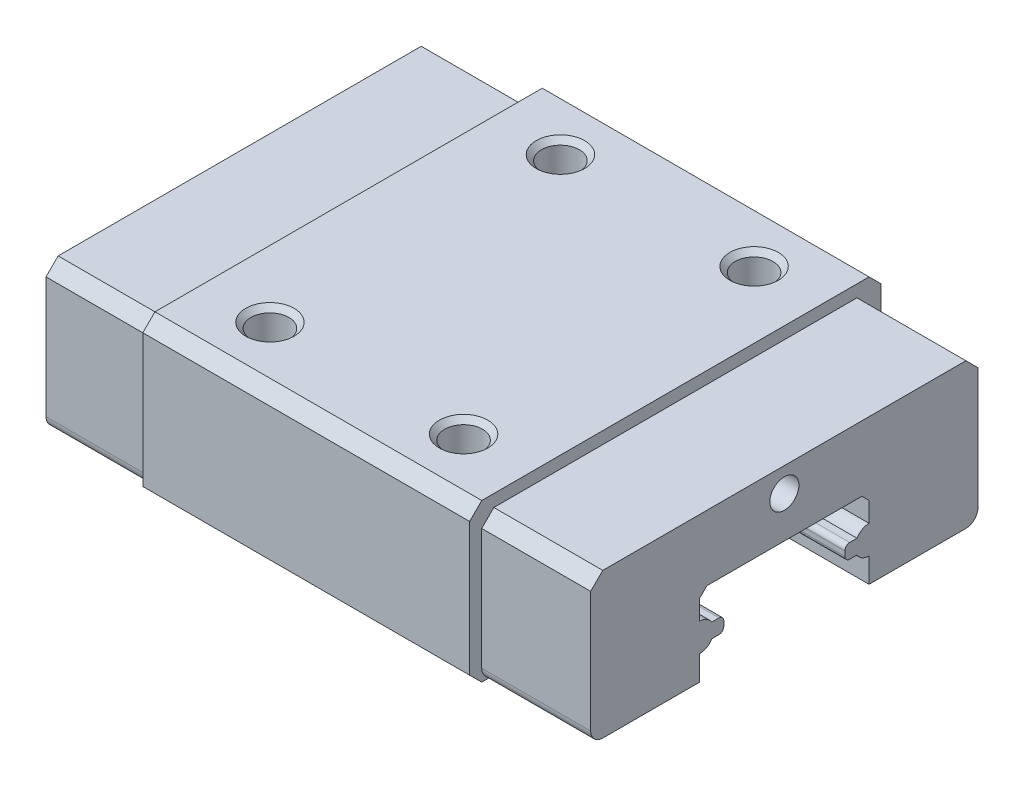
ISO-10303-21;
HEADER;
FILE_DESCRIPTION(('STEP AP214'),'2;1');
FILE_NAME('part.step','',(''),(''),'','','');
FILE_SCHEMA(('AUTOMOTIVE_DESIGN { 1 0 10303 214 1 1 1 1 }'));
ENDSEC;
DATA;
#1=APPLICATION_CONTEXT('core data for automotive mechanical design processes');
#2=APPLICATION_PROTOCOL_DEFINITION('international standard','automotive_design',2000,#1);
#3=PRODUCT_CONTEXT('',#1,'mechanical');
#4=PRODUCT('Part','Part','',(#3));
#5=PRODUCT_RELATED_PRODUCT_CATEGORY('part','',(#4));
#6=PRODUCT_DEFINITION_FORMATION('','',#4);
#7=PRODUCT_DEFINITION_CONTEXT('part definition',#1,'design');
#8=PRODUCT_DEFINITION('design','',#6,#7);
#9=PRODUCT_DEFINITION_SHAPE('','',#8);
#10=(LENGTH_UNIT() NAMED_UNIT(*) SI_UNIT(.MILLI.,.METRE.));
#11=(NAMED_UNIT(*) PLANE_ANGLE_UNIT() SI_UNIT($,.RADIAN.));
#12=(NAMED_UNIT(*) SI_UNIT($,.STERADIAN.) SOLID_ANGLE_UNIT());
#13=UNCERTAINTY_MEASURE_WITH_UNIT(LENGTH_MEASURE(1.E-05),#10,'distance_accuracy_value','');
#14=(GEOMETRIC_REPRESENTATION_CONTEXT(3) GLOBAL_UNCERTAINTY_ASSIGNED_CONTEXT((#13)) GLOBAL_UNIT_ASSIGNED_CONTEXT((#10,
#11,#12)) REPRESENTATION_CONTEXT('',''));
#15=CARTESIAN_POINT('',(0.,0.,0.));
#16=DIRECTION('',(0.,0.,1.));
#17=DIRECTION('',(1.,0.,0.));
#18=AXIS2_PLACEMENT_3D('',#15,#16,#17);
#19=CARTESIAN_POINT('',(40.5,6.,-7.5));
#20=DIRECTION('',(0.,-1.,0.));
#21=DIRECTION('',(0.,0.,-1.));
#22=AXIS2_PLACEMENT_3D('',#19,#20,#21);
#23=PLANE('',#22);
#24=DIRECTION('',(0.,0.,-1.));
#25=VECTOR('',#24,1.);
#26=CARTESIAN_POINT('',(22.5,6.,3.5));
#27=LINE('',#26,#25);
#28=CARTESIAN_POINT('',(22.5,6.,7.5));
#29=VERTEX_POINT('',#28);
#30=CARTESIAN_POINT('',(22.5,6.,-7.5));
#31=VERTEX_POINT('',#30);
#32=EDGE_CURVE('E11',#29,#31,#27,.T.);
#33=ORIENTED_EDGE('',*,*,#32,.T.);
#34=DIRECTION('',(-1.,0.,0.));
#35=VECTOR('',#34,1.);
#36=CARTESIAN_POINT('',(40.5,6.,-7.5));
#37=LINE('',#36,#35);
#38=CARTESIAN_POINT('',(18.,6.,-7.5));
#39=VERTEX_POINT('',#38);
#40=EDGE_CURVE('E28',#31,#39,#37,.T.);
#41=ORIENTED_EDGE('',*,*,#40,.T.);
#42=DIRECTION('',(0.,0.,1.));
#43=VECTOR('',#42,1.);
#44=CARTESIAN_POINT('',(18.,6.,-7.5));
#45=LINE('',#44,#43);
#46=CARTESIAN_POINT('',(18.,6.,7.5));
#47=VERTEX_POINT('',#46);
#48=EDGE_CURVE('E580',#39,#47,#45,.T.);
#49=ORIENTED_EDGE('',*,*,#48,.T.);
#50=DIRECTION('',(-1.,0.,0.));
#51=VECTOR('',#50,1.);
#52=CARTESIAN_POINT('',(40.5,6.,7.5));
#53=LINE('',#52,#51);
#54=EDGE_CURVE('E761',#29,#47,#53,.T.);
#55=ORIENTED_EDGE('',*,*,#54,.F.);
#56=EDGE_LOOP('',(#33,#41,#49,#55));
#57=FACE_BOUND('',#56,.T.);
#58=ADVANCED_FACE('F17',(#57),#23,.F.);
#59=CARTESIAN_POINT('',(40.5,5.5,-8.));
#60=DIRECTION('',(0.,-0.707106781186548,0.707106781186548));
#61=DIRECTION('',(-1.,0.,0.));
#62=AXIS2_PLACEMENT_3D('',#59,#60,#61);
#63=PLANE('',#62);
#64=DIRECTION('',(0.,-0.707106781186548,-0.707106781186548));
#65=VECTOR('',#64,1.);
#66=CARTESIAN_POINT('',(22.5,9.3,-4.2));
#67=LINE('',#66,#65);
#68=CARTESIAN_POINT('',(22.5,5.5,-8.));
#69=VERTEX_POINT('',#68);
#70=EDGE_CURVE('E518',#31,#69,#67,.T.);
#71=ORIENTED_EDGE('',*,*,#70,.T.);
#72=DIRECTION('',(-1.,0.,0.));
#73=VECTOR('',#72,1.);
#74=CARTESIAN_POINT('',(40.5,5.5,-8.));
#75=LINE('',#74,#73);
#76=CARTESIAN_POINT('',(18.,5.5,-8.));
#77=VERTEX_POINT('',#76);
#78=EDGE_CURVE('E514',#69,#77,#75,.T.);
#79=ORIENTED_EDGE('',*,*,#78,.T.);
#80=DIRECTION('',(0.,0.707106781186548,0.707106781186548));
#81=VECTOR('',#80,1.);
#82=CARTESIAN_POINT('',(18.,5.5,-8.));
#83=LINE('',#82,#81);
#84=EDGE_CURVE('E519',#77,#39,#83,.T.);
#85=ORIENTED_EDGE('',*,*,#84,.T.);
#86=ORIENTED_EDGE('',*,*,#40,.F.);
#87=EDGE_LOOP('',(#71,#79,#85,#86));
#88=FACE_BOUND('',#87,.T.);
#89=ADVANCED_FACE('F1236',(#88),#63,.F.);
#90=CARTESIAN_POINT('',(40.5,6.,7.5));
#91=DIRECTION('',(0.,-0.707106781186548,-0.707106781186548));
#92=DIRECTION('',(0.,-0.707106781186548,0.707106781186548));
#93=AXIS2_PLACEMENT_3D('',#90,#91,#92);
#94=PLANE('',#93);
#95=DIRECTION('',(0.,0.707106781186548,-0.707106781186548));
#96=VECTOR('',#95,1.);
#97=CARTESIAN_POINT('',(22.5,5.8,7.7));
#98=LINE('',#97,#96);
#99=CARTESIAN_POINT('',(22.5,5.5,8.));
#100=VERTEX_POINT('',#99);
#101=EDGE_CURVE('E718',#100,#29,#98,.T.);
#102=ORIENTED_EDGE('',*,*,#101,.T.);
#103=ORIENTED_EDGE('',*,*,#54,.T.);
#104=DIRECTION('',(0.,-0.707106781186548,0.707106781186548));
#105=VECTOR('',#104,1.);
#106=CARTESIAN_POINT('',(18.,6.,7.5));
#107=LINE('',#106,#105);
#108=CARTESIAN_POINT('',(18.,5.5,8.));
#109=VERTEX_POINT('',#108);
#110=EDGE_CURVE('E407',#47,#109,#107,.T.);
#111=ORIENTED_EDGE('',*,*,#110,.T.);
#112=DIRECTION('',(-1.,0.,0.));
#113=VECTOR('',#112,1.);
#114=CARTESIAN_POINT('',(40.5,5.5,8.));
#115=LINE('',#114,#113);
#116=EDGE_CURVE('E828',#100,#109,#115,.T.);
#117=ORIENTED_EDGE('',*,*,#116,.F.);
#118=EDGE_LOOP('',(#102,#103,#111,#117));
#119=FACE_BOUND('',#118,.T.);
#120=ADVANCED_FACE('F1157',(#119),#94,.F.);
#121=CARTESIAN_POINT('',(22.5,6.,8.5));
#122=DIRECTION('',(0.,0.,-1.));
#123=DIRECTION('',(0.,-1.,0.));
#124=AXIS2_PLACEMENT_3D('',#121,#122,#123);
#125=PLANE('',#124);
#126=DIRECTION('',(0.,-1.,0.));
#127=VECTOR('',#126,1.);
#128=CARTESIAN_POINT('',(18.,6.5,8.5));
#129=LINE('',#128,#127);
#130=CARTESIAN_POINT('',(18.,6.,8.5));
#131=VERTEX_POINT('',#130);
#132=CARTESIAN_POINT('',(18.,0.5,8.5));
#133=VERTEX_POINT('',#132);
#134=EDGE_CURVE('E829',#131,#133,#129,.T.);
#135=ORIENTED_EDGE('',*,*,#134,.F.);
#136=DIRECTION('',(-1.,0.,0.));
#137=VECTOR('',#136,1.);
#138=CARTESIAN_POINT('',(22.5,6.,8.5));
#139=LINE('',#138,#137);
#140=CARTESIAN_POINT('',(4.5,6.,8.5));
#141=VERTEX_POINT('',#140);
#142=EDGE_CURVE('E403',#131,#141,#139,.T.);
#143=ORIENTED_EDGE('',*,*,#142,.T.);
#144=DIRECTION('',(0.,-1.,0.));
#145=VECTOR('',#144,1.);
#146=CARTESIAN_POINT('',(4.5,6.5,8.5));
#147=LINE('',#146,#145);
#148=CARTESIAN_POINT('',(4.5,0.5,8.5));
#149=VERTEX_POINT('',#148);
#150=EDGE_CURVE('E408',#141,#149,#147,.T.);
#151=ORIENTED_EDGE('',*,*,#150,.T.);
#152=DIRECTION('',(-1.,0.,0.));
#153=VECTOR('',#152,1.);
#154=CARTESIAN_POINT('',(22.5,0.5,8.5));
#155=LINE('',#154,#153);
#156=EDGE_CURVE('E460',#133,#149,#155,.T.);
#157=ORIENTED_EDGE('',*,*,#156,.F.);
#158=EDGE_LOOP('',(#135,#143,#151,#157));
#159=FACE_BOUND('',#158,.T.);
#160=ADVANCED_FACE('F1319',(#159),#125,.F.);
#161=CARTESIAN_POINT('',(22.5,0.5,8.5));
#162=DIRECTION('',(0.,0.707106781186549,-0.707106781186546));
#163=DIRECTION('',(-1.,0.,0.));
#164=AXIS2_PLACEMENT_3D('',#161,#162,#163);
#165=PLANE('',#164);
#166=DIRECTION('',(0.,-0.707106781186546,-0.707106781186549));
#167=VECTOR('',#166,1.);
#168=CARTESIAN_POINT('',(18.,0.5,8.5));
#169=LINE('',#168,#167);
#170=CARTESIAN_POINT('',(18.,0.,8.));
#171=VERTEX_POINT('',#170);
#172=EDGE_CURVE('E691',#133,#171,#169,.T.);
#173=ORIENTED_EDGE('',*,*,#172,.F.);
#174=ORIENTED_EDGE('',*,*,#156,.T.);
#175=DIRECTION('',(0.,-0.707106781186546,-0.707106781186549));
#176=VECTOR('',#175,1.);
#177=CARTESIAN_POINT('',(4.5,0.5,8.5));
#178=LINE('',#177,#176);
#179=CARTESIAN_POINT('',(4.5,0.,8.));
#180=VERTEX_POINT('',#179);
#181=EDGE_CURVE('E456',#149,#180,#178,.T.);
#182=ORIENTED_EDGE('',*,*,#181,.T.);
#183=DIRECTION('',(-1.,0.,0.));
#184=VECTOR('',#183,1.);
#185=CARTESIAN_POINT('',(22.5,0.,8.));
#186=LINE('',#185,#184);
#187=EDGE_CURVE('E490',#171,#180,#186,.T.);
#188=ORIENTED_EDGE('',*,*,#187,.F.);
#189=EDGE_LOOP('',(#173,#174,#182,#188));
#190=FACE_BOUND('',#189,.T.);
#191=ADVANCED_FACE('F1285',(#190),#165,.F.);
#192=CARTESIAN_POINT('',(19.1,5.,0.));
#193=DIRECTION('',(-1.,0.,0.));
#194=DIRECTION('',(0.,0.,-1.));
#195=AXIS2_PLACEMENT_3D('',#192,#193,#194);
#196=CYLINDRICAL_SURFACE('',#195,0.6);
#197=CARTESIAN_POINT('',(22.5,5.,0.));
#198=DIRECTION('',(1.,0.,0.));
#199=DIRECTION('',(0.,0.,-1.));
#200=AXIS2_PLACEMENT_3D('',#197,#198,#199);
#201=CIRCLE('',#200,0.6);
#202=CARTESIAN_POINT('',(22.5,5.,-0.6));
#203=VERTEX_POINT('',#202);
#204=EDGE_CURVE('E461',#203,#203,#201,.T.);
#205=ORIENTED_EDGE('',*,*,#204,.T.);
#206=EDGE_LOOP('',(#205));
#207=FACE_BOUND('',#206,.T.);
#208=CARTESIAN_POINT('',(19.1,5.,0.));
#209=DIRECTION('',(1.,0.,0.));
#210=DIRECTION('',(0.,0.,-1.));
#211=AXIS2_PLACEMENT_3D('',#208,#209,#210);
#212=CIRCLE('',#211,0.6);
#213=CARTESIAN_POINT('',(19.1,5.,-0.6));
#214=VERTEX_POINT('',#213);
#215=EDGE_CURVE('E455',#214,#214,#212,.T.);
#216=ORIENTED_EDGE('',*,*,#215,.F.);
#217=EDGE_LOOP('',(#216));
#218=FACE_BOUND('',#217,.T.);
#219=ADVANCED_FACE('F1282',(#207,#218),#196,.F.);
#220=CARTESIAN_POINT('',(22.5,1.6,3.5));
#221=DIRECTION('',(1.,0.,0.));
#222=DIRECTION('',(0.,1.,0.));
#223=AXIS2_PLACEMENT_3D('',#220,#221,#222);
#224=PLANE('',#223);
#225=CARTESIAN_POINT('',(22.5,0.5,-7.5));
#226=DIRECTION('',(-1.,0.,0.));
#227=DIRECTION('',(0.,0.,-1.));
#228=AXIS2_PLACEMENT_3D('',#225,#226,#227);
#229=CIRCLE('',#228,0.5);
#230=CARTESIAN_POINT('',(22.5,0.5,-8.));
#231=VERTEX_POINT('',#230);
#232=CARTESIAN_POINT('',(22.5,0.,-7.5));
#233=VERTEX_POINT('',#232);
#234=EDGE_CURVE('E536',#231,#233,#229,.T.);
#235=ORIENTED_EDGE('',*,*,#234,.F.);
#236=DIRECTION('',(0.,-1.,0.));
#237=VECTOR('',#236,1.);
#238=CARTESIAN_POINT('',(22.5,1.6,-8.));
#239=LINE('',#238,#237);
#240=EDGE_CURVE('E708',#69,#231,#239,.T.);
#241=ORIENTED_EDGE('',*,*,#240,.F.);
#242=ORIENTED_EDGE('',*,*,#70,.F.);
#243=ORIENTED_EDGE('',*,*,#32,.F.);
#244=ORIENTED_EDGE('',*,*,#101,.F.);
#245=DIRECTION('',(0.,1.,0.));
#246=VECTOR('',#245,1.);
#247=CARTESIAN_POINT('',(22.5,1.6,8.));
#248=LINE('',#247,#246);
#249=CARTESIAN_POINT('',(22.5,0.5,8.));
#250=VERTEX_POINT('',#249);
#251=EDGE_CURVE('E870',#250,#100,#248,.T.);
#252=ORIENTED_EDGE('',*,*,#251,.F.);
#253=CARTESIAN_POINT('',(22.5,0.5,7.5));
#254=DIRECTION('',(-1.,0.,0.));
#255=DIRECTION('',(0.,0.,-1.));
#256=AXIS2_PLACEMENT_3D('',#253,#254,#255);
#257=CIRCLE('',#256,0.5);
#258=CARTESIAN_POINT('',(22.5,0.,7.5));
#259=VERTEX_POINT('',#258);
#260=EDGE_CURVE('E530',#259,#250,#257,.T.);
#261=ORIENTED_EDGE('',*,*,#260,.F.);
#262=DIRECTION('',(0.,0.,-1.));
#263=VECTOR('',#262,1.);
#264=CARTESIAN_POINT('',(22.5,0.,8.));
#265=LINE('',#264,#263);
#266=CARTESIAN_POINT('',(22.5,0.,3.5));
#267=VERTEX_POINT('',#266);
#268=EDGE_CURVE('E595',#259,#267,#265,.T.);
#269=ORIENTED_EDGE('',*,*,#268,.T.);
#270=DIRECTION('',(0.,1.,0.));
#271=VECTOR('',#270,1.);
#272=CARTESIAN_POINT('',(22.5,0.,3.5));
#273=LINE('',#272,#271);
#274=CARTESIAN_POINT('',(22.5,1.01690481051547,3.5));
#275=VERTEX_POINT('',#274);
#276=EDGE_CURVE('E472',#267,#275,#273,.T.);
#277=ORIENTED_EDGE('',*,*,#276,.T.);
#278=CARTESIAN_POINT('',(22.5,1.6,3.5));
#279=DIRECTION('',(1.,0.,0.));
#280=DIRECTION('',(0.,0.,-1.));
#281=AXIS2_PLACEMENT_3D('',#278,#279,#280);
#282=CIRCLE('',#281,0.5830951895);
#283=CARTESIAN_POINT('',(22.5,1.3,3.));
#284=VERTEX_POINT('',#283);
#285=EDGE_CURVE('E468',#275,#284,#282,.T.);
#286=ORIENTED_EDGE('',*,*,#285,.T.);
#287=DIRECTION('',(0.,0.,-1.));
#288=VECTOR('',#287,1.);
#289=CARTESIAN_POINT('',(22.5,1.3,3.));
#290=LINE('',#289,#288);
#291=CARTESIAN_POINT('',(22.5,1.3,2.7));
#292=VERTEX_POINT('',#291);
#293=EDGE_CURVE('E473',#284,#292,#290,.T.);
#294=ORIENTED_EDGE('',*,*,#293,.T.);
#295=CARTESIAN_POINT('',(22.5,1.5,2.7));
#296=DIRECTION('',(1.,0.,0.));
#297=DIRECTION('',(0.,0.,-1.));
#298=AXIS2_PLACEMENT_3D('',#295,#296,#297);
#299=CIRCLE('',#298,0.2);
#300=CARTESIAN_POINT('',(22.5,1.5,2.5));
#301=VERTEX_POINT('',#300);
#302=EDGE_CURVE('E690',#292,#301,#299,.T.);
#303=ORIENTED_EDGE('',*,*,#302,.T.);
#304=DIRECTION('',(0.,1.,0.));
#305=VECTOR('',#304,1.);
#306=CARTESIAN_POINT('',(22.5,1.5,2.5));
#307=LINE('',#306,#305);
#308=CARTESIAN_POINT('',(22.5,1.7,2.5));
#309=VERTEX_POINT('',#308);
#310=EDGE_CURVE('E610',#301,#309,#307,.T.);
#311=ORIENTED_EDGE('',*,*,#310,.T.);
#312=CARTESIAN_POINT('',(22.5,1.7,2.7));
#313=DIRECTION('',(1.,0.,0.));
#314=DIRECTION('',(0.,0.,-1.));
#315=AXIS2_PLACEMENT_3D('',#312,#313,#314);
#316=CIRCLE('',#315,0.2);
#317=CARTESIAN_POINT('',(22.5,1.9,2.7));
#318=VERTEX_POINT('',#317);
#319=EDGE_CURVE('E606',#309,#318,#316,.T.);
#320=ORIENTED_EDGE('',*,*,#319,.T.);
#321=DIRECTION('',(0.,0.,1.));
#322=VECTOR('',#321,1.);
#323=CARTESIAN_POINT('',(22.5,1.9,2.7));
#324=LINE('',#323,#322);
#325=CARTESIAN_POINT('',(22.5,1.9,3.));
#326=VERTEX_POINT('',#325);
#327=EDGE_CURVE('E611',#318,#326,#324,.T.);
#328=ORIENTED_EDGE('',*,*,#327,.T.);
#329=CARTESIAN_POINT('',(22.5,1.6,3.5));
#330=DIRECTION('',(1.,0.,0.));
#331=DIRECTION('',(0.,0.,-1.));
#332=AXIS2_PLACEMENT_3D('',#329,#330,#331);
#333=CIRCLE('',#332,0.5830951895);
#334=CARTESIAN_POINT('',(22.5,2.18309518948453,3.5));
#335=VERTEX_POINT('',#334);
#336=EDGE_CURVE('E425',#326,#335,#333,.T.);
#337=ORIENTED_EDGE('',*,*,#336,.T.);
#338=DIRECTION('',(0.,1.,0.));
#339=VECTOR('',#338,1.);
#340=CARTESIAN_POINT('',(22.5,2.18309518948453,3.5));
#341=LINE('',#340,#339);
#342=CARTESIAN_POINT('',(22.5,3.,3.5));
#343=VERTEX_POINT('',#342);
#344=EDGE_CURVE('E421',#335,#343,#341,.T.);
#345=ORIENTED_EDGE('',*,*,#344,.T.);
#346=DIRECTION('',(0.,0.707106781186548,-0.707106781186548));
#347=VECTOR('',#346,1.);
#348=CARTESIAN_POINT('',(22.5,3.,3.5));
#349=LINE('',#348,#347);
#350=CARTESIAN_POINT('',(22.5,3.3,3.2));
#351=VERTEX_POINT('',#350);
#352=EDGE_CURVE('E426',#343,#351,#349,.T.);
#353=ORIENTED_EDGE('',*,*,#352,.T.);
#354=DIRECTION('',(0.,0.,-1.));
#355=VECTOR('',#354,1.);
#356=CARTESIAN_POINT('',(22.5,3.3,3.2));
#357=LINE('',#356,#355);
#358=CARTESIAN_POINT('',(22.5,3.3,-3.2));
#359=VERTEX_POINT('',#358);
#360=EDGE_CURVE('E540',#351,#359,#357,.T.);
#361=ORIENTED_EDGE('',*,*,#360,.T.);
#362=DIRECTION('',(0.,-0.707106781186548,-0.707106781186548));
#363=VECTOR('',#362,1.);
#364=CARTESIAN_POINT('',(22.5,3.3,-3.2));
#365=LINE('',#364,#363);
#366=CARTESIAN_POINT('',(22.5,3.,-3.5));
#367=VERTEX_POINT('',#366);
#368=EDGE_CURVE('E544',#359,#367,#365,.T.);
#369=ORIENTED_EDGE('',*,*,#368,.T.);
#370=DIRECTION('',(0.,-1.,0.));
#371=VECTOR('',#370,1.);
#372=CARTESIAN_POINT('',(22.5,3.,-3.5));
#373=LINE('',#372,#371);
#374=CARTESIAN_POINT('',(22.5,2.18309518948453,-3.5));
#375=VERTEX_POINT('',#374);
#376=EDGE_CURVE('E585',#367,#375,#373,.T.);
#377=ORIENTED_EDGE('',*,*,#376,.T.);
#378=CARTESIAN_POINT('',(22.5,1.6,-3.5));
#379=DIRECTION('',(1.,0.,0.));
#380=DIRECTION('',(0.,0.,-1.));
#381=AXIS2_PLACEMENT_3D('',#378,#379,#380);
#382=CIRCLE('',#381,0.5830951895);
#383=CARTESIAN_POINT('',(22.5,1.9,-3.));
#384=VERTEX_POINT('',#383);
#385=EDGE_CURVE('E387',#375,#384,#382,.T.);
#386=ORIENTED_EDGE('',*,*,#385,.T.);
#387=DIRECTION('',(0.,0.,1.));
#388=VECTOR('',#387,1.);
#389=CARTESIAN_POINT('',(22.5,1.9,-3.));
#390=LINE('',#389,#388);
#391=CARTESIAN_POINT('',(22.5,1.9,-2.7));
#392=VERTEX_POINT('',#391);
#393=EDGE_CURVE('E496',#384,#392,#390,.T.);
#394=ORIENTED_EDGE('',*,*,#393,.T.);
#395=CARTESIAN_POINT('',(22.5,1.7,-2.7));
#396=DIRECTION('',(1.,0.,0.));
#397=DIRECTION('',(0.,0.,-1.));
#398=AXIS2_PLACEMENT_3D('',#395,#396,#397);
#399=CIRCLE('',#398,0.2);
#400=CARTESIAN_POINT('',(22.5,1.7,-2.5));
#401=VERTEX_POINT('',#400);
#402=EDGE_CURVE('E500',#392,#401,#399,.T.);
#403=ORIENTED_EDGE('',*,*,#402,.T.);
#404=DIRECTION('',(0.,-1.,0.));
#405=VECTOR('',#404,1.);
#406=CARTESIAN_POINT('',(22.5,1.7,-2.5));
#407=LINE('',#406,#405);
#408=CARTESIAN_POINT('',(22.5,1.5,-2.5));
#409=VERTEX_POINT('',#408);
#410=EDGE_CURVE('E605',#401,#409,#407,.T.);
#411=ORIENTED_EDGE('',*,*,#410,.T.);
#412=CARTESIAN_POINT('',(22.5,1.5,-2.7));
#413=DIRECTION('',(1.,0.,0.));
#414=DIRECTION('',(0.,0.,-1.));
#415=AXIS2_PLACEMENT_3D('',#412,#413,#414);
#416=CIRCLE('',#415,0.2);
#417=CARTESIAN_POINT('',(22.5,1.3,-2.7));
#418=VERTEX_POINT('',#417);
#419=EDGE_CURVE('E768',#409,#418,#416,.T.);
#420=ORIENTED_EDGE('',*,*,#419,.T.);
#421=DIRECTION('',(0.,0.,-1.));
#422=VECTOR('',#421,1.);
#423=CARTESIAN_POINT('',(22.5,1.3,-2.7));
#424=LINE('',#423,#422);
#425=CARTESIAN_POINT('',(22.5,1.3,-3.));
#426=VERTEX_POINT('',#425);
#427=EDGE_CURVE('E736',#418,#426,#424,.T.);
#428=ORIENTED_EDGE('',*,*,#427,.T.);
#429=CARTESIAN_POINT('',(22.5,1.6,-3.5));
#430=DIRECTION('',(1.,0.,0.));
#431=DIRECTION('',(0.,0.,-1.));
#432=AXIS2_PLACEMENT_3D('',#429,#430,#431);
#433=CIRCLE('',#432,0.5830951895);
#434=CARTESIAN_POINT('',(22.5,1.01690481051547,-3.5));
#435=VERTEX_POINT('',#434);
#436=EDGE_CURVE('E732',#426,#435,#433,.T.);
#437=ORIENTED_EDGE('',*,*,#436,.T.);
#438=DIRECTION('',(0.,-1.,0.));
#439=VECTOR('',#438,1.);
#440=CARTESIAN_POINT('',(22.5,1.01690481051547,-3.5));
#441=LINE('',#440,#439);
#442=CARTESIAN_POINT('',(22.5,0.,-3.5));
#443=VERTEX_POINT('',#442);
#444=EDGE_CURVE('E737',#435,#443,#441,.T.);
#445=ORIENTED_EDGE('',*,*,#444,.T.);
#446=DIRECTION('',(0.,0.,-1.));
#447=VECTOR('',#446,1.);
#448=CARTESIAN_POINT('',(22.5,0.,-3.5));
#449=LINE('',#448,#447);
#450=EDGE_CURVE('E488',#443,#233,#449,.T.);
#451=ORIENTED_EDGE('',*,*,#450,.T.);
#452=EDGE_LOOP('',(#235,#241,#242,#243,#244,#252,#261,#269,#277,#286,#294,#303,#311,#320,#328,
#337,#345,#353,#361,#369,#377,#386,#394,#403,#411,#420,#428,#437,#445,#451));
#453=FACE_BOUND('',#452,.T.);
#454=ORIENTED_EDGE('',*,*,#204,.F.);
#455=EDGE_LOOP('',(#454));
#456=FACE_BOUND('',#455,.T.);
#457=ADVANCED_FACE('F19',(#453,#456),#224,.T.);
#458=CARTESIAN_POINT('',(4.5,0.,0.));
#459=DIRECTION('',(1.,0.,0.));
#460=DIRECTION('',(0.,1.,0.));
#461=AXIS2_PLACEMENT_3D('',#458,#459,#460);
#462=PLANE('',#461);
#463=ORIENTED_EDGE('',*,*,#150,.F.);
#464=DIRECTION('',(0.,-0.707106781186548,0.707106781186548));
#465=VECTOR('',#464,1.);
#466=CARTESIAN_POINT('',(4.5,6.5,8.));
#467=LINE('',#466,#465);
#468=CARTESIAN_POINT('',(4.5,6.5,8.));
#469=VERTEX_POINT('',#468);
#470=EDGE_CURVE('E715',#469,#141,#467,.T.);
#471=ORIENTED_EDGE('',*,*,#470,.F.);
#472=DIRECTION('',(0.,0.,1.));
#473=VECTOR('',#472,1.);
#474=CARTESIAN_POINT('',(4.5,6.5,-8.5));
#475=LINE('',#474,#473);
#476=CARTESIAN_POINT('',(4.5,6.5,-8.));
#477=VERTEX_POINT('',#476);
#478=EDGE_CURVE('E431',#477,#469,#475,.T.);
#479=ORIENTED_EDGE('',*,*,#478,.F.);
#480=DIRECTION('',(0.,0.707106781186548,0.707106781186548));
#481=VECTOR('',#480,1.);
#482=CARTESIAN_POINT('',(4.5,6.,-8.5));
#483=LINE('',#482,#481);
#484=CARTESIAN_POINT('',(4.5,6.,-8.5));
#485=VERTEX_POINT('',#484);
#486=EDGE_CURVE('E571',#485,#477,#483,.T.);
#487=ORIENTED_EDGE('',*,*,#486,.F.);
#488=DIRECTION('',(0.,1.,0.));
#489=VECTOR('',#488,1.);
#490=CARTESIAN_POINT('',(4.5,-1.,-8.5));
#491=LINE('',#490,#489);
#492=CARTESIAN_POINT('',(4.5,0.5,-8.5));
#493=VERTEX_POINT('',#492);
#494=EDGE_CURVE('E401',#493,#485,#491,.T.);
#495=ORIENTED_EDGE('',*,*,#494,.F.);
#496=DIRECTION('',(0.,0.707106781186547,-0.707106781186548));
#497=VECTOR('',#496,1.);
#498=CARTESIAN_POINT('',(4.5,0.,-8.));
#499=LINE('',#498,#497);
#500=CARTESIAN_POINT('',(4.5,0.,-8.));
#501=VERTEX_POINT('',#500);
#502=EDGE_CURVE('E402',#501,#493,#499,.T.);
#503=ORIENTED_EDGE('',*,*,#502,.F.);
#504=DIRECTION('',(0.,0.,-1.));
#505=VECTOR('',#504,1.);
#506=CARTESIAN_POINT('',(4.5,0.,-3.5));
#507=LINE('',#506,#505);
#508=CARTESIAN_POINT('',(4.5,0.,-7.5));
#509=VERTEX_POINT('',#508);
#510=EDGE_CURVE('E449',#509,#501,#507,.T.);
#511=ORIENTED_EDGE('',*,*,#510,.F.);
#512=CARTESIAN_POINT('',(4.5,0.5,-7.5));
#513=DIRECTION('',(1.,0.,0.));
#514=DIRECTION('',(0.,0.,-1.));
#515=AXIS2_PLACEMENT_3D('',#512,#513,#514);
#516=CIRCLE('',#515,0.5);
#517=CARTESIAN_POINT('',(4.5,0.5,-8.));
#518=VERTEX_POINT('',#517);
#519=EDGE_CURVE('E484',#509,#518,#516,.T.);
#520=ORIENTED_EDGE('',*,*,#519,.T.);
#521=DIRECTION('',(0.,1.,0.));
#522=VECTOR('',#521,1.);
#523=CARTESIAN_POINT('',(4.5,0.5,-8.));
#524=LINE('',#523,#522);
#525=CARTESIAN_POINT('',(4.5,5.5,-8.));
#526=VERTEX_POINT('',#525);
#527=EDGE_CURVE('E489',#518,#526,#524,.T.);
#528=ORIENTED_EDGE('',*,*,#527,.T.);
#529=DIRECTION('',(0.,0.707106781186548,0.707106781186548));
#530=VECTOR('',#529,1.);
#531=CARTESIAN_POINT('',(4.5,5.5,-8.));
#532=LINE('',#531,#530);
#533=CARTESIAN_POINT('',(4.5,6.,-7.5));
#534=VERTEX_POINT('',#533);
#535=EDGE_CURVE('E466',#526,#534,#532,.T.);
#536=ORIENTED_EDGE('',*,*,#535,.T.);
#537=DIRECTION('',(0.,0.,1.));
#538=VECTOR('',#537,1.);
#539=CARTESIAN_POINT('',(4.5,6.,-7.5));
#540=LINE('',#539,#538);
#541=CARTESIAN_POINT('',(4.5,6.,7.5));
#542=VERTEX_POINT('',#541);
#543=EDGE_CURVE('E462',#534,#542,#540,.T.);
#544=ORIENTED_EDGE('',*,*,#543,.T.);
#545=DIRECTION('',(0.,-0.707106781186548,0.707106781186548));
#546=VECTOR('',#545,1.);
#547=CARTESIAN_POINT('',(4.5,6.,7.5));
#548=LINE('',#547,#546);
#549=CARTESIAN_POINT('',(4.5,5.5,8.));
#550=VERTEX_POINT('',#549);
#551=EDGE_CURVE('E467',#542,#550,#548,.T.);
#552=ORIENTED_EDGE('',*,*,#551,.T.);
#553=DIRECTION('',(0.,-1.,0.));
#554=VECTOR('',#553,1.);
#555=CARTESIAN_POINT('',(4.5,5.5,8.));
#556=LINE('',#555,#554);
#557=CARTESIAN_POINT('',(4.5,0.5,8.));
#558=VERTEX_POINT('',#557);
#559=EDGE_CURVE('E548',#550,#558,#556,.T.);
#560=ORIENTED_EDGE('',*,*,#559,.T.);
#561=CARTESIAN_POINT('',(4.5,0.5,7.5));
#562=DIRECTION('',(1.,0.,0.));
#563=DIRECTION('',(0.,0.,-1.));
#564=AXIS2_PLACEMENT_3D('',#561,#562,#563);
#565=CIRCLE('',#564,0.5);
#566=CARTESIAN_POINT('',(4.5,0.,7.5));
#567=VERTEX_POINT('',#566);
#568=EDGE_CURVE('E513',#558,#567,#565,.T.);
#569=ORIENTED_EDGE('',*,*,#568,.T.);
#570=DIRECTION('',(0.,0.,-1.));
#571=VECTOR('',#570,1.);
#572=CARTESIAN_POINT('',(4.5,0.,8.));
#573=LINE('',#572,#571);
#574=EDGE_CURVE('E495',#180,#567,#573,.T.);
#575=ORIENTED_EDGE('',*,*,#574,.F.);
#576=ORIENTED_EDGE('',*,*,#181,.F.);
#577=EDGE_LOOP('',(#463,#471,#479,#487,#495,#503,#511,#520,#528,#536,#544,#552,#560,#569,#575,#576));
#578=FACE_BOUND('',#577,.T.);
#579=ADVANCED_FACE('F1322',(#578),#462,.F.);
#580=CARTESIAN_POINT('',(22.5,0.,-3.5));
#581=DIRECTION('',(0.,1.,0.));
#582=DIRECTION('',(1.,0.,0.));
#583=AXIS2_PLACEMENT_3D('',#580,#581,#582);
#584=PLANE('',#583);
#585=DIRECTION('',(-1.,0.,0.));
#586=VECTOR('',#585,1.);
#587=CARTESIAN_POINT('',(22.5,0.,-3.5));
#588=LINE('',#587,#586);
#589=CARTESIAN_POINT('',(0.,0.,-3.5));
#590=VERTEX_POINT('',#589);
#591=EDGE_CURVE('E509',#443,#590,#588,.T.);
#592=ORIENTED_EDGE('',*,*,#591,.T.);
#593=DIRECTION('',(0.,0.,-1.));
#594=VECTOR('',#593,1.);
#595=CARTESIAN_POINT('',(0.,0.,-3.5));
#596=LINE('',#595,#594);
#597=CARTESIAN_POINT('',(0.,0.,-7.5));
#598=VERTEX_POINT('',#597);
#599=EDGE_CURVE('E448',#590,#598,#596,.T.);
#600=ORIENTED_EDGE('',*,*,#599,.T.);
#601=DIRECTION('',(1.,0.,0.));
#602=VECTOR('',#601,1.);
#603=CARTESIAN_POINT('',(-18.,0.,-7.5));
#604=LINE('',#603,#602);
#605=EDGE_CURVE('E444',#598,#509,#604,.T.);
#606=ORIENTED_EDGE('',*,*,#605,.T.);
#607=ORIENTED_EDGE('',*,*,#510,.T.);
#608=DIRECTION('',(-1.,0.,0.));
#609=VECTOR('',#608,1.);
#610=CARTESIAN_POINT('',(22.5,0.,-8.));
#611=LINE('',#610,#609);
#612=CARTESIAN_POINT('',(18.,0.,-8.));
#613=VERTEX_POINT('',#612);
#614=EDGE_CURVE('E398',#613,#501,#611,.T.);
#615=ORIENTED_EDGE('',*,*,#614,.F.);
#616=DIRECTION('',(0.,0.,-1.));
#617=VECTOR('',#616,1.);
#618=CARTESIAN_POINT('',(18.,0.,-3.5));
#619=LINE('',#618,#617);
#620=CARTESIAN_POINT('',(18.,0.,-7.5));
#621=VERTEX_POINT('',#620);
#622=EDGE_CURVE('E803',#621,#613,#619,.T.);
#623=ORIENTED_EDGE('',*,*,#622,.F.);
#624=DIRECTION('',(-1.,0.,0.));
#625=VECTOR('',#624,1.);
#626=CARTESIAN_POINT('',(40.5,0.,-7.5));
#627=LINE('',#626,#625);
#628=EDGE_CURVE('E539',#233,#621,#627,.T.);
#629=ORIENTED_EDGE('',*,*,#628,.F.);
#630=ORIENTED_EDGE('',*,*,#450,.F.);
#631=EDGE_LOOP('',(#592,#600,#606,#607,#615,#623,#629,#630));
#632=FACE_BOUND('',#631,.T.);
#633=ADVANCED_FACE('F959',(#632),#584,.F.);
#634=CARTESIAN_POINT('',(0.,1.6,3.5));
#635=DIRECTION('',(1.,0.,0.));
#636=DIRECTION('',(0.,1.,0.));
#637=AXIS2_PLACEMENT_3D('',#634,#635,#636);
#638=PLANE('',#637);
#639=CARTESIAN_POINT('',(0.,0.5,-7.5));
#640=DIRECTION('',(1.,0.,0.));
#641=DIRECTION('',(0.,0.,-1.));
#642=AXIS2_PLACEMENT_3D('',#639,#640,#641);
#643=CIRCLE('',#642,0.5);
#644=CARTESIAN_POINT('',(0.,0.5,-8.));
#645=VERTEX_POINT('',#644);
#646=EDGE_CURVE('E558',#598,#645,#643,.T.);
#647=ORIENTED_EDGE('',*,*,#646,.F.);
#648=ORIENTED_EDGE('',*,*,#599,.F.);
#649=DIRECTION('',(0.,-1.,0.));
#650=VECTOR('',#649,1.);
#651=CARTESIAN_POINT('',(0.,1.01690481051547,-3.5));
#652=LINE('',#651,#650);
#653=CARTESIAN_POINT('',(0.,1.01690481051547,-3.5));
#654=VERTEX_POINT('',#653);
#655=EDGE_CURVE('E504',#654,#590,#652,.T.);
#656=ORIENTED_EDGE('',*,*,#655,.F.);
#657=CARTESIAN_POINT('',(0.,1.6,-3.5));
#658=DIRECTION('',(1.,0.,0.));
#659=DIRECTION('',(0.,0.,-1.));
#660=AXIS2_PLACEMENT_3D('',#657,#658,#659);
#661=CIRCLE('',#660,0.5830951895);
#662=CARTESIAN_POINT('',(0.,1.3,-3.));
#663=VERTEX_POINT('',#662);
#664=EDGE_CURVE('E419',#663,#654,#661,.T.);
#665=ORIENTED_EDGE('',*,*,#664,.F.);
#666=DIRECTION('',(0.,0.,-1.));
#667=VECTOR('',#666,1.);
#668=CARTESIAN_POINT('',(0.,1.3,-2.7));
#669=LINE('',#668,#667);
#670=CARTESIAN_POINT('',(0.,1.3,-2.7));
#671=VERTEX_POINT('',#670);
#672=EDGE_CURVE('E420',#671,#663,#669,.T.);
#673=ORIENTED_EDGE('',*,*,#672,.F.);
#674=CARTESIAN_POINT('',(0.,1.5,-2.7));
#675=DIRECTION('',(1.,0.,0.));
#676=DIRECTION('',(0.,0.,-1.));
#677=AXIS2_PLACEMENT_3D('',#674,#675,#676);
#678=CIRCLE('',#677,0.2);
#679=CARTESIAN_POINT('',(0.,1.5,-2.5));
#680=VERTEX_POINT('',#679);
#681=EDGE_CURVE('E524',#680,#671,#678,.T.);
#682=ORIENTED_EDGE('',*,*,#681,.F.);
#683=DIRECTION('',(0.,-1.,0.));
#684=VECTOR('',#683,1.);
#685=CARTESIAN_POINT('',(0.,1.7,-2.5));
#686=LINE('',#685,#684);
#687=CARTESIAN_POINT('',(0.,1.7,-2.5));
#688=VERTEX_POINT('',#687);
#689=EDGE_CURVE('E525',#688,#680,#686,.T.);
#690=ORIENTED_EDGE('',*,*,#689,.F.);
#691=CARTESIAN_POINT('',(0.,1.7,-2.7));
#692=DIRECTION('',(1.,0.,0.));
#693=DIRECTION('',(0.,0.,-1.));
#694=AXIS2_PLACEMENT_3D('',#691,#692,#693);
#695=CIRCLE('',#694,0.2);
#696=CARTESIAN_POINT('',(0.,1.9,-2.7));
#697=VERTEX_POINT('',#696);
#698=EDGE_CURVE('E660',#697,#688,#695,.T.);
#699=ORIENTED_EDGE('',*,*,#698,.F.);
#700=DIRECTION('',(0.,0.,1.));
#701=VECTOR('',#700,1.);
#702=CARTESIAN_POINT('',(0.,1.9,-3.));
#703=LINE('',#702,#701);
#704=CARTESIAN_POINT('',(0.,1.9,-3.));
#705=VERTEX_POINT('',#704);
#706=EDGE_CURVE('E377',#705,#697,#703,.T.);
#707=ORIENTED_EDGE('',*,*,#706,.F.);
#708=CARTESIAN_POINT('',(0.,1.6,-3.5));
#709=DIRECTION('',(1.,0.,0.));
#710=DIRECTION('',(0.,0.,-1.));
#711=AXIS2_PLACEMENT_3D('',#708,#709,#710);
#712=CIRCLE('',#711,0.5830951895);
#713=CARTESIAN_POINT('',(0.,2.18309518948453,-3.5));
#714=VERTEX_POINT('',#713);
#715=EDGE_CURVE('E372',#714,#705,#712,.T.);
#716=ORIENTED_EDGE('',*,*,#715,.F.);
#717=DIRECTION('',(0.,-1.,0.));
#718=VECTOR('',#717,1.);
#719=CARTESIAN_POINT('',(0.,3.,-3.5));
#720=LINE('',#719,#718);
#721=CARTESIAN_POINT('',(0.,3.,-3.5));
#722=VERTEX_POINT('',#721);
#723=EDGE_CURVE('E359',#722,#714,#720,.T.);
#724=ORIENTED_EDGE('',*,*,#723,.F.);
#725=DIRECTION('',(0.,-0.707106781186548,-0.707106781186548));
#726=VECTOR('',#725,1.);
#727=CARTESIAN_POINT('',(0.,3.3,-3.2));
#728=LINE('',#727,#726);
#729=CARTESIAN_POINT('',(0.,3.3,-3.2));
#730=VERTEX_POINT('',#729);
#731=EDGE_CURVE('E588',#730,#722,#728,.T.);
#732=ORIENTED_EDGE('',*,*,#731,.F.);
#733=DIRECTION('',(0.,0.,-1.));
#734=VECTOR('',#733,1.);
#735=CARTESIAN_POINT('',(0.,3.3,3.2));
#736=LINE('',#735,#734);
#737=CARTESIAN_POINT('',(0.,3.3,3.2));
#738=VERTEX_POINT('',#737);
#739=EDGE_CURVE('E703',#738,#730,#736,.T.);
#740=ORIENTED_EDGE('',*,*,#739,.F.);
#741=DIRECTION('',(0.,0.707106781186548,-0.707106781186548));
#742=VECTOR('',#741,1.);
#743=CARTESIAN_POINT('',(0.,3.,3.5));
#744=LINE('',#743,#742);
#745=CARTESIAN_POINT('',(0.,3.,3.5));
#746=VERTEX_POINT('',#745);
#747=EDGE_CURVE('E483',#746,#738,#744,.T.);
#748=ORIENTED_EDGE('',*,*,#747,.F.);
#749=DIRECTION('',(0.,1.,0.));
#750=VECTOR('',#749,1.);
#751=CARTESIAN_POINT('',(0.,2.18309518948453,3.5));
#752=LINE('',#751,#750);
#753=CARTESIAN_POINT('',(0.,2.18309518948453,3.5));
#754=VERTEX_POINT('',#753);
#755=EDGE_CURVE('E409',#754,#746,#752,.T.);
#756=ORIENTED_EDGE('',*,*,#755,.F.);
#757=CARTESIAN_POINT('',(0.,1.6,3.5));
#758=DIRECTION('',(1.,0.,0.));
#759=DIRECTION('',(0.,0.,-1.));
#760=AXIS2_PLACEMENT_3D('',#757,#758,#759);
#761=CIRCLE('',#760,0.5830951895);
#762=CARTESIAN_POINT('',(0.,1.9,3.));
#763=VERTEX_POINT('',#762);
#764=EDGE_CURVE('E786',#763,#754,#761,.T.);
#765=ORIENTED_EDGE('',*,*,#764,.F.);
#766=DIRECTION('',(0.,0.,1.));
#767=VECTOR('',#766,1.);
#768=CARTESIAN_POINT('',(0.,1.9,2.7));
#769=LINE('',#768,#767);
#770=CARTESIAN_POINT('',(0.,1.9,2.7));
#771=VERTEX_POINT('',#770);
#772=EDGE_CURVE('E651',#771,#763,#769,.T.);
#773=ORIENTED_EDGE('',*,*,#772,.F.);
#774=CARTESIAN_POINT('',(0.,1.7,2.7));
#775=DIRECTION('',(1.,0.,0.));
#776=DIRECTION('',(0.,0.,-1.));
#777=AXIS2_PLACEMENT_3D('',#774,#775,#776);
#778=CIRCLE('',#777,0.2);
#779=CARTESIAN_POINT('',(0.,1.7,2.5));
#780=VERTEX_POINT('',#779);
#781=EDGE_CURVE('E731',#780,#771,#778,.T.);
#782=ORIENTED_EDGE('',*,*,#781,.F.);
#783=DIRECTION('',(0.,1.,0.));
#784=VECTOR('',#783,1.);
#785=CARTESIAN_POINT('',(0.,1.5,2.5));
#786=LINE('',#785,#784);
#787=CARTESIAN_POINT('',(0.,1.5,2.5));
#788=VERTEX_POINT('',#787);
#789=EDGE_CURVE('E680',#788,#780,#786,.T.);
#790=ORIENTED_EDGE('',*,*,#789,.F.);
#791=CARTESIAN_POINT('',(0.,1.5,2.7));
#792=DIRECTION('',(1.,0.,0.));
#793=DIRECTION('',(0.,0.,-1.));
#794=AXIS2_PLACEMENT_3D('',#791,#792,#793);
#795=CIRCLE('',#794,0.2);
#796=CARTESIAN_POINT('',(0.,1.3,2.7));
#797=VERTEX_POINT('',#796);
#798=EDGE_CURVE('E664',#797,#788,#795,.T.);
#799=ORIENTED_EDGE('',*,*,#798,.F.);
#800=DIRECTION('',(0.,0.,-1.));
#801=VECTOR('',#800,1.);
#802=CARTESIAN_POINT('',(0.,1.3,3.));
#803=LINE('',#802,#801);
#804=CARTESIAN_POINT('',(0.,1.3,3.));
#805=VERTEX_POINT('',#804);
#806=EDGE_CURVE('E647',#805,#797,#803,.T.);
#807=ORIENTED_EDGE('',*,*,#806,.F.);
#808=CARTESIAN_POINT('',(0.,1.6,3.5));
#809=DIRECTION('',(1.,0.,0.));
#810=DIRECTION('',(0.,0.,-1.));
#811=AXIS2_PLACEMENT_3D('',#808,#809,#810);
#812=CIRCLE('',#811,0.5830951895);
#813=CARTESIAN_POINT('',(0.,1.01690481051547,3.5));
#814=VERTEX_POINT('',#813);
#815=EDGE_CURVE('E648',#814,#805,#812,.T.);
#816=ORIENTED_EDGE('',*,*,#815,.F.);
#817=DIRECTION('',(0.,1.,0.));
#818=VECTOR('',#817,1.);
#819=CARTESIAN_POINT('',(0.,0.,3.5));
#820=LINE('',#819,#818);
#821=CARTESIAN_POINT('',(0.,0.,3.5));
#822=VERTEX_POINT('',#821);
#823=EDGE_CURVE('E723',#822,#814,#820,.T.);
#824=ORIENTED_EDGE('',*,*,#823,.F.);
#825=DIRECTION('',(0.,0.,-1.));
#826=VECTOR('',#825,1.);
#827=CARTESIAN_POINT('',(0.,0.,8.));
#828=LINE('',#827,#826);
#829=CARTESIAN_POINT('',(0.,0.,7.5));
#830=VERTEX_POINT('',#829);
#831=EDGE_CURVE('E566',#830,#822,#828,.T.);
#832=ORIENTED_EDGE('',*,*,#831,.F.);
#833=CARTESIAN_POINT('',(0.,0.5,7.5));
#834=DIRECTION('',(1.,0.,0.));
#835=DIRECTION('',(0.,0.,-1.));
#836=AXIS2_PLACEMENT_3D('',#833,#834,#835);
#837=CIRCLE('',#836,0.5);
#838=CARTESIAN_POINT('',(0.,0.5,8.));
#839=VERTEX_POINT('',#838);
#840=EDGE_CURVE('E620',#839,#830,#837,.T.);
#841=ORIENTED_EDGE('',*,*,#840,.F.);
#842=DIRECTION('',(0.,-1.,0.));
#843=VECTOR('',#842,1.);
#844=CARTESIAN_POINT('',(0.,1.6,8.));
#845=LINE('',#844,#843);
#846=CARTESIAN_POINT('',(0.,5.5,8.));
#847=VERTEX_POINT('',#846);
#848=EDGE_CURVE('E636',#847,#839,#845,.T.);
#849=ORIENTED_EDGE('',*,*,#848,.F.);
#850=DIRECTION('',(0.,-0.707106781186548,0.707106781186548));
#851=VECTOR('',#850,1.);
#852=CARTESIAN_POINT('',(0.,5.8,7.7));
#853=LINE('',#852,#851);
#854=CARTESIAN_POINT('',(0.,6.,7.5));
#855=VERTEX_POINT('',#854);
#856=EDGE_CURVE('E553',#855,#847,#853,.T.);
#857=ORIENTED_EDGE('',*,*,#856,.F.);
#858=DIRECTION('',(0.,0.,1.));
#859=VECTOR('',#858,1.);
#860=CARTESIAN_POINT('',(0.,6.,3.5));
#861=LINE('',#860,#859);
#862=CARTESIAN_POINT('',(0.,6.,-7.5));
#863=VERTEX_POINT('',#862);
#864=EDGE_CURVE('E433',#863,#855,#861,.T.);
#865=ORIENTED_EDGE('',*,*,#864,.F.);
#866=DIRECTION('',(0.,0.707106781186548,0.707106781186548));
#867=VECTOR('',#866,1.);
#868=CARTESIAN_POINT('',(0.,9.3,-4.2));
#869=LINE('',#868,#867);
#870=CARTESIAN_POINT('',(0.,5.5,-8.));
#871=VERTEX_POINT('',#870);
#872=EDGE_CURVE('E742',#871,#863,#869,.T.);
#873=ORIENTED_EDGE('',*,*,#872,.F.);
#874=DIRECTION('',(0.,1.,0.));
#875=VECTOR('',#874,1.);
#876=CARTESIAN_POINT('',(0.,1.6,-8.));
#877=LINE('',#876,#875);
#878=EDGE_CURVE('E474',#645,#871,#877,.T.);
#879=ORIENTED_EDGE('',*,*,#878,.F.);
#880=EDGE_LOOP('',(#647,#648,#656,#665,#673,#682,#690,#699,#707,#716,#724,#732,#740,#748,#756,
#765,#773,#782,#790,#799,#807,#816,#824,#832,#841,#849,#857,#865,#873,#879));
#881=FACE_BOUND('',#880,.T.);
#882=CARTESIAN_POINT('',(0.,5.,0.));
#883=DIRECTION('',(1.,0.,0.));
#884=DIRECTION('',(0.,0.,-1.));
#885=AXIS2_PLACEMENT_3D('',#882,#883,#884);
#886=CIRCLE('',#885,0.6);
#887=CARTESIAN_POINT('',(0.,5.,-0.6));
#888=VERTEX_POINT('',#887);
#889=EDGE_CURVE('E811',#888,#888,#886,.T.);
#890=ORIENTED_EDGE('',*,*,#889,.T.);
#891=EDGE_LOOP('',(#890));
#892=FACE_BOUND('',#891,.T.);
#893=ADVANCED_FACE('F374',(#881,#892),#638,.F.);
#894=CARTESIAN_POINT('',(22.5,6.5,8.));
#895=DIRECTION('',(0.,-0.707106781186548,-0.707106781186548));
#896=DIRECTION('',(0.,-0.707106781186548,0.707106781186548));
#897=AXIS2_PLACEMENT_3D('',#894,#895,#896);
#898=PLANE('',#897);
#899=DIRECTION('',(0.,-0.707106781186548,0.707106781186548));
#900=VECTOR('',#899,1.);
#901=CARTESIAN_POINT('',(18.,6.5,8.));
#902=LINE('',#901,#900);
#903=CARTESIAN_POINT('',(18.,6.5,8.));
#904=VERTEX_POINT('',#903);
#905=EDGE_CURVE('E832',#904,#131,#902,.T.);
#906=ORIENTED_EDGE('',*,*,#905,.F.);
#907=DIRECTION('',(-1.,0.,0.));
#908=VECTOR('',#907,1.);
#909=CARTESIAN_POINT('',(22.5,6.5,8.));
#910=LINE('',#909,#908);
#911=EDGE_CURVE('E807',#904,#469,#910,.T.);
#912=ORIENTED_EDGE('',*,*,#911,.T.);
#913=ORIENTED_EDGE('',*,*,#470,.T.);
#914=ORIENTED_EDGE('',*,*,#142,.F.);
#915=EDGE_LOOP('',(#906,#912,#913,#914));
#916=FACE_BOUND('',#915,.T.);
#917=ADVANCED_FACE('F1360',(#916),#898,.F.);
#918=CARTESIAN_POINT('',(22.5,6.5,-8.));
#919=DIRECTION('',(0.,-1.,0.));
#920=DIRECTION('',(0.,0.,-1.));
#921=AXIS2_PLACEMENT_3D('',#918,#919,#920);
#922=PLANE('',#921);
#923=DIRECTION('',(0.,0.,1.));
#924=VECTOR('',#923,1.);
#925=CARTESIAN_POINT('',(18.,6.5,-8.5));
#926=LINE('',#925,#924);
#927=CARTESIAN_POINT('',(18.,6.5,-8.));
#928=VERTEX_POINT('',#927);
#929=EDGE_CURVE('E577',#928,#904,#926,.T.);
#930=ORIENTED_EDGE('',*,*,#929,.F.);
#931=DIRECTION('',(-1.,0.,0.));
#932=VECTOR('',#931,1.);
#933=CARTESIAN_POINT('',(22.5,6.5,-8.));
#934=LINE('',#933,#932);
#935=EDGE_CURVE('E711',#928,#477,#934,.T.);
#936=ORIENTED_EDGE('',*,*,#935,.T.);
#937=ORIENTED_EDGE('',*,*,#478,.T.);
#938=ORIENTED_EDGE('',*,*,#911,.F.);
#939=EDGE_LOOP('',(#930,#936,#937,#938));
#940=FACE_BOUND('',#939,.T.);
#941=CARTESIAN_POINT('',(15.25,6.5,-6.));
#942=DIRECTION('',(0.,-1.,0.));
#943=DIRECTION('',(0.,0.,-1.));
#944=AXIS2_PLACEMENT_3D('',#941,#942,#943);
#945=CIRCLE('',#944,1.);
#946=CARTESIAN_POINT('',(15.25,6.5,-7.));
#947=VERTEX_POINT('',#946);
#948=EDGE_CURVE('E427',#947,#947,#945,.T.);
#949=ORIENTED_EDGE('',*,*,#948,.T.);
#950=EDGE_LOOP('',(#949));
#951=FACE_BOUND('',#950,.T.);
#952=CARTESIAN_POINT('',(7.25,6.5,-6.));
#953=DIRECTION('',(0.,-1.,0.));
#954=DIRECTION('',(0.,0.,-1.));
#955=AXIS2_PLACEMENT_3D('',#952,#953,#954);
#956=CIRCLE('',#955,1.);
#957=CARTESIAN_POINT('',(7.25,6.5,-7.));
#958=VERTEX_POINT('',#957);
#959=EDGE_CURVE('E432',#958,#958,#956,.T.);
#960=ORIENTED_EDGE('',*,*,#959,.T.);
#961=EDGE_LOOP('',(#960));
#962=FACE_BOUND('',#961,.T.);
#963=CARTESIAN_POINT('',(15.25,6.5,6.));
#964=DIRECTION('',(0.,-1.,0.));
#965=DIRECTION('',(0.,0.,-1.));
#966=AXIS2_PLACEMENT_3D('',#963,#964,#965);
#967=CIRCLE('',#966,1.);
#968=CARTESIAN_POINT('',(15.25,6.5,5.));
#969=VERTEX_POINT('',#968);
#970=EDGE_CURVE('E535',#969,#969,#967,.T.);
#971=ORIENTED_EDGE('',*,*,#970,.T.);
#972=EDGE_LOOP('',(#971));
#973=FACE_BOUND('',#972,.T.);
#974=CARTESIAN_POINT('',(7.25,6.5,6.));
#975=DIRECTION('',(0.,-1.,0.));
#976=DIRECTION('',(0.,0.,-1.));
#977=AXIS2_PLACEMENT_3D('',#974,#975,#976);
#978=CIRCLE('',#977,1.);
#979=CARTESIAN_POINT('',(7.25,6.5,5.));
#980=VERTEX_POINT('',#979);
#981=EDGE_CURVE('E584',#980,#980,#978,.T.);
#982=ORIENTED_EDGE('',*,*,#981,.T.);
#983=EDGE_LOOP('',(#982));
#984=FACE_BOUND('',#983,.T.);
#985=ADVANCED_FACE('F1252',(#940,#951,#962,#973,#984),#922,.F.);
#986=CARTESIAN_POINT('',(22.5,6.,-8.5));
#987=DIRECTION('',(0.,-0.707106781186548,0.707106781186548));
#988=DIRECTION('',(-1.,0.,0.));
#989=AXIS2_PLACEMENT_3D('',#986,#987,#988);
#990=PLANE('',#989);
#991=DIRECTION('',(0.,0.707106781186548,0.707106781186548));
#992=VECTOR('',#991,1.);
#993=CARTESIAN_POINT('',(18.,6.,-8.5));
#994=LINE('',#993,#992);
#995=CARTESIAN_POINT('',(18.,6.,-8.5));
#996=VERTEX_POINT('',#995);
#997=EDGE_CURVE('E572',#996,#928,#994,.T.);
#998=ORIENTED_EDGE('',*,*,#997,.F.);
#999=DIRECTION('',(-1.,0.,0.));
#1000=VECTOR('',#999,1.);
#1001=CARTESIAN_POINT('',(22.5,6.,-8.5));
#1002=LINE('',#1001,#1000);
#1003=EDGE_CURVE('E598',#996,#485,#1002,.T.);
#1004=ORIENTED_EDGE('',*,*,#1003,.T.);
#1005=ORIENTED_EDGE('',*,*,#486,.T.);
#1006=ORIENTED_EDGE('',*,*,#935,.F.);
#1007=EDGE_LOOP('',(#998,#1004,#1005,#1006));
#1008=FACE_BOUND('',#1007,.T.);
#1009=ADVANCED_FACE('F1248',(#1008),#990,.F.);
#1010=CARTESIAN_POINT('',(22.5,0.5,-8.5));
#1011=DIRECTION('',(0.,0.,1.));
#1012=DIRECTION('',(1.,0.,0.));
#1013=AXIS2_PLACEMENT_3D('',#1010,#1011,#1012);
#1014=PLANE('',#1013);
#1015=DIRECTION('',(0.,1.,0.));
#1016=VECTOR('',#1015,1.);
#1017=CARTESIAN_POINT('',(18.,-1.,-8.5));
#1018=LINE('',#1017,#1016);
#1019=CARTESIAN_POINT('',(18.,0.5,-8.5));
#1020=VERTEX_POINT('',#1019);
#1021=EDGE_CURVE('E576',#1020,#996,#1018,.T.);
#1022=ORIENTED_EDGE('',*,*,#1021,.F.);
#1023=DIRECTION('',(-1.,0.,0.));
#1024=VECTOR('',#1023,1.);
#1025=CARTESIAN_POINT('',(22.5,0.5,-8.5));
#1026=LINE('',#1025,#1024);
#1027=EDGE_CURVE('E567',#1020,#493,#1026,.T.);
#1028=ORIENTED_EDGE('',*,*,#1027,.T.);
#1029=ORIENTED_EDGE('',*,*,#494,.T.);
#1030=ORIENTED_EDGE('',*,*,#1003,.F.);
#1031=EDGE_LOOP('',(#1022,#1028,#1029,#1030));
#1032=FACE_BOUND('',#1031,.T.);
#1033=ADVANCED_FACE('F1251',(#1032),#1014,.F.);
#1034=CARTESIAN_POINT('',(22.5,0.,-8.));
#1035=DIRECTION('',(0.,0.707106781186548,0.707106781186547));
#1036=DIRECTION('',(1.,0.,0.));
#1037=AXIS2_PLACEMENT_3D('',#1034,#1035,#1036);
#1038=PLANE('',#1037);
#1039=DIRECTION('',(0.,0.707106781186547,-0.707106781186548));
#1040=VECTOR('',#1039,1.);
#1041=CARTESIAN_POINT('',(18.,0.,-8.));
#1042=LINE('',#1041,#1040);
#1043=EDGE_CURVE('E617',#613,#1020,#1042,.T.);
#1044=ORIENTED_EDGE('',*,*,#1043,.F.);
#1045=ORIENTED_EDGE('',*,*,#614,.T.);
#1046=ORIENTED_EDGE('',*,*,#502,.T.);
#1047=ORIENTED_EDGE('',*,*,#1027,.F.);
#1048=EDGE_LOOP('',(#1044,#1045,#1046,#1047));
#1049=FACE_BOUND('',#1048,.T.);
#1050=ADVANCED_FACE('F1278',(#1049),#1038,.F.);
#1051=CARTESIAN_POINT('',(22.5,1.01690481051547,-3.5));
#1052=DIRECTION('',(0.,0.,-1.));
#1053=DIRECTION('',(0.,-1.,0.));
#1054=AXIS2_PLACEMENT_3D('',#1051,#1052,#1053);
#1055=PLANE('',#1054);
#1056=ORIENTED_EDGE('',*,*,#655,.T.);
#1057=ORIENTED_EDGE('',*,*,#591,.F.);
#1058=ORIENTED_EDGE('',*,*,#444,.F.);
#1059=DIRECTION('',(-1.,0.,0.));
#1060=VECTOR('',#1059,1.);
#1061=CARTESIAN_POINT('',(22.5,1.01690481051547,-3.5));
#1062=LINE('',#1061,#1060);
#1063=EDGE_CURVE('E508',#435,#654,#1062,.T.);
#1064=ORIENTED_EDGE('',*,*,#1063,.T.);
#1065=EDGE_LOOP('',(#1056,#1057,#1058,#1064));
#1066=FACE_BOUND('',#1065,.T.);
#1067=ADVANCED_FACE('F1066',(#1066),#1055,.F.);
#1068=CARTESIAN_POINT('',(22.5,1.6,-3.5));
#1069=DIRECTION('',(1.,0.,0.));
#1070=DIRECTION('',(0.,0.,1.));
#1071=AXIS2_PLACEMENT_3D('',#1068,#1069,#1070);
#1072=CYLINDRICAL_SURFACE('',#1071,0.5830951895);
#1073=ORIENTED_EDGE('',*,*,#664,.T.);
#1074=ORIENTED_EDGE('',*,*,#1063,.F.);
#1075=ORIENTED_EDGE('',*,*,#436,.F.);
#1076=DIRECTION('',(-1.,0.,0.));
#1077=VECTOR('',#1076,1.);
#1078=CARTESIAN_POINT('',(22.5,1.3,-3.));
#1079=LINE('',#1078,#1077);
#1080=EDGE_CURVE('E415',#426,#663,#1079,.T.);
#1081=ORIENTED_EDGE('',*,*,#1080,.T.);
#1082=EDGE_LOOP('',(#1073,#1074,#1075,#1081));
#1083=FACE_BOUND('',#1082,.T.);
#1084=ADVANCED_FACE('F1060',(#1083),#1072,.T.);
#1085=CARTESIAN_POINT('',(22.5,1.3,-2.7));
#1086=DIRECTION('',(0.,1.,0.));
#1087=DIRECTION('',(1.,0.,0.));
#1088=AXIS2_PLACEMENT_3D('',#1085,#1086,#1087);
#1089=PLANE('',#1088);
#1090=ORIENTED_EDGE('',*,*,#672,.T.);
#1091=ORIENTED_EDGE('',*,*,#1080,.F.);
#1092=ORIENTED_EDGE('',*,*,#427,.F.);
#1093=DIRECTION('',(-1.,0.,0.));
#1094=VECTOR('',#1093,1.);
#1095=CARTESIAN_POINT('',(22.5,1.3,-2.7));
#1096=LINE('',#1095,#1094);
#1097=EDGE_CURVE('E554',#418,#671,#1096,.T.);
#1098=ORIENTED_EDGE('',*,*,#1097,.T.);
#1099=EDGE_LOOP('',(#1090,#1091,#1092,#1098));
#1100=FACE_BOUND('',#1099,.T.);
#1101=ADVANCED_FACE('F1116',(#1100),#1089,.F.);
#1102=CARTESIAN_POINT('',(22.5,1.5,-2.7));
#1103=DIRECTION('',(1.,0.,0.));
#1104=DIRECTION('',(0.,0.,1.));
#1105=AXIS2_PLACEMENT_3D('',#1102,#1103,#1104);
#1106=CYLINDRICAL_SURFACE('',#1105,0.2);
#1107=ORIENTED_EDGE('',*,*,#681,.T.);
#1108=ORIENTED_EDGE('',*,*,#1097,.F.);
#1109=ORIENTED_EDGE('',*,*,#419,.F.);
#1110=DIRECTION('',(-1.,0.,0.));
#1111=VECTOR('',#1110,1.);
#1112=CARTESIAN_POINT('',(22.5,1.5,-2.5));
#1113=LINE('',#1112,#1111);
#1114=EDGE_CURVE('E520',#409,#680,#1113,.T.);
#1115=ORIENTED_EDGE('',*,*,#1114,.T.);
#1116=EDGE_LOOP('',(#1107,#1108,#1109,#1115));
#1117=FACE_BOUND('',#1116,.T.);
#1118=ADVANCED_FACE('F1121',(#1117),#1106,.T.);
#1119=CARTESIAN_POINT('',(22.5,1.7,-2.5));
#1120=DIRECTION('',(0.,0.,-1.));
#1121=DIRECTION('',(0.,-1.,0.));
#1122=AXIS2_PLACEMENT_3D('',#1119,#1120,#1121);
#1123=PLANE('',#1122);
#1124=ORIENTED_EDGE('',*,*,#689,.T.);
#1125=ORIENTED_EDGE('',*,*,#1114,.F.);
#1126=ORIENTED_EDGE('',*,*,#410,.F.);
#1127=DIRECTION('',(-1.,0.,0.));
#1128=VECTOR('',#1127,1.);
#1129=CARTESIAN_POINT('',(22.5,1.7,-2.5));
#1130=LINE('',#1129,#1128);
#1131=EDGE_CURVE('E656',#401,#688,#1130,.T.);
#1132=ORIENTED_EDGE('',*,*,#1131,.T.);
#1133=EDGE_LOOP('',(#1124,#1125,#1126,#1132));
#1134=FACE_BOUND('',#1133,.T.);
#1135=ADVANCED_FACE('F1123',(#1134),#1123,.F.);
#1136=CARTESIAN_POINT('',(22.5,1.7,-2.7));
#1137=DIRECTION('',(1.,0.,0.));
#1138=DIRECTION('',(0.,0.,1.));
#1139=AXIS2_PLACEMENT_3D('',#1136,#1137,#1138);
#1140=CYLINDRICAL_SURFACE('',#1139,0.2);
#1141=ORIENTED_EDGE('',*,*,#698,.T.);
#1142=ORIENTED_EDGE('',*,*,#1131,.F.);
#1143=ORIENTED_EDGE('',*,*,#402,.F.);
#1144=DIRECTION('',(-1.,0.,0.));
#1145=VECTOR('',#1144,1.);
#1146=CARTESIAN_POINT('',(22.5,1.9,-2.7));
#1147=LINE('',#1146,#1145);
#1148=EDGE_CURVE('E503',#392,#697,#1147,.T.);
#1149=ORIENTED_EDGE('',*,*,#1148,.T.);
#1150=EDGE_LOOP('',(#1141,#1142,#1143,#1149));
#1151=FACE_BOUND('',#1150,.T.);
#1152=ADVANCED_FACE('F1222',(#1151),#1140,.T.);
#1153=CARTESIAN_POINT('',(22.5,1.9,-3.));
#1154=DIRECTION('',(0.,-1.,0.));
#1155=DIRECTION('',(0.,0.,-1.));
#1156=AXIS2_PLACEMENT_3D('',#1153,#1154,#1155);
#1157=PLANE('',#1156);
#1158=ORIENTED_EDGE('',*,*,#706,.T.);
#1159=ORIENTED_EDGE('',*,*,#1148,.F.);
#1160=ORIENTED_EDGE('',*,*,#393,.F.);
#1161=DIRECTION('',(-1.,0.,0.));
#1162=VECTOR('',#1161,1.);
#1163=CARTESIAN_POINT('',(22.5,1.9,-3.));
#1164=LINE('',#1163,#1162);
#1165=EDGE_CURVE('E382',#384,#705,#1164,.T.);
#1166=ORIENTED_EDGE('',*,*,#1165,.T.);
#1167=EDGE_LOOP('',(#1158,#1159,#1160,#1166));
#1168=FACE_BOUND('',#1167,.T.);
#1169=ADVANCED_FACE('F1220',(#1168),#1157,.F.);
#1170=CARTESIAN_POINT('',(22.5,1.6,-3.5));
#1171=DIRECTION('',(1.,0.,0.));
#1172=DIRECTION('',(0.,0.,1.));
#1173=AXIS2_PLACEMENT_3D('',#1170,#1171,#1172);
#1174=CYLINDRICAL_SURFACE('',#1173,0.5830951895);
#1175=ORIENTED_EDGE('',*,*,#715,.T.);
#1176=ORIENTED_EDGE('',*,*,#1165,.F.);
#1177=ORIENTED_EDGE('',*,*,#385,.F.);
#1178=DIRECTION('',(-1.,0.,0.));
#1179=VECTOR('',#1178,1.);
#1180=CARTESIAN_POINT('',(22.5,2.18309518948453,-3.5));
#1181=LINE('',#1180,#1179);
#1182=EDGE_CURVE('E364',#375,#714,#1181,.T.);
#1183=ORIENTED_EDGE('',*,*,#1182,.T.);
#1184=EDGE_LOOP('',(#1175,#1176,#1177,#1183));
#1185=FACE_BOUND('',#1184,.T.);
#1186=ADVANCED_FACE('F385',(#1185),#1174,.T.);
#1187=CARTESIAN_POINT('',(22.5,3.,-3.5));
#1188=DIRECTION('',(0.,0.,-1.));
#1189=DIRECTION('',(0.,-1.,0.));
#1190=AXIS2_PLACEMENT_3D('',#1187,#1188,#1189);
#1191=PLANE('',#1190);
#1192=ORIENTED_EDGE('',*,*,#723,.T.);
#1193=ORIENTED_EDGE('',*,*,#1182,.F.);
#1194=ORIENTED_EDGE('',*,*,#376,.F.);
#1195=DIRECTION('',(-1.,0.,0.));
#1196=VECTOR('',#1195,1.);
#1197=CARTESIAN_POINT('',(22.5,3.,-3.5));
#1198=LINE('',#1197,#1196);
#1199=EDGE_CURVE('E366',#367,#722,#1198,.T.);
#1200=ORIENTED_EDGE('',*,*,#1199,.T.);
#1201=EDGE_LOOP('',(#1192,#1193,#1194,#1200));
#1202=FACE_BOUND('',#1201,.T.);
#1203=ADVANCED_FACE('F361',(#1202),#1191,.F.);
#1204=CARTESIAN_POINT('',(22.5,3.3,-3.2));
#1205=DIRECTION('',(0.,0.707106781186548,-0.707106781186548));
#1206=DIRECTION('',(-1.,0.,0.));
#1207=AXIS2_PLACEMENT_3D('',#1204,#1205,#1206);
#1208=PLANE('',#1207);
#1209=ORIENTED_EDGE('',*,*,#731,.T.);
#1210=ORIENTED_EDGE('',*,*,#1199,.F.);
#1211=ORIENTED_EDGE('',*,*,#368,.F.);
#1212=DIRECTION('',(-1.,0.,0.));
#1213=VECTOR('',#1212,1.);
#1214=CARTESIAN_POINT('',(22.5,3.3,-3.2));
#1215=LINE('',#1214,#1213);
#1216=EDGE_CURVE('E591',#359,#730,#1215,.T.);
#1217=ORIENTED_EDGE('',*,*,#1216,.T.);
#1218=EDGE_LOOP('',(#1209,#1210,#1211,#1217));
#1219=FACE_BOUND('',#1218,.T.);
#1220=ADVANCED_FACE('F1215',(#1219),#1208,.F.);
#1221=CARTESIAN_POINT('',(22.5,3.3,3.2));
#1222=DIRECTION('',(0.,1.,0.));
#1223=DIRECTION('',(1.,0.,0.));
#1224=AXIS2_PLACEMENT_3D('',#1221,#1222,#1223);
#1225=PLANE('',#1224);
#1226=ORIENTED_EDGE('',*,*,#739,.T.);
#1227=ORIENTED_EDGE('',*,*,#1216,.F.);
#1228=ORIENTED_EDGE('',*,*,#360,.F.);
#1229=DIRECTION('',(-1.,0.,0.));
#1230=VECTOR('',#1229,1.);
#1231=CARTESIAN_POINT('',(22.5,3.3,3.2));
#1232=LINE('',#1231,#1230);
#1233=EDGE_CURVE('E815',#351,#738,#1232,.T.);
#1234=ORIENTED_EDGE('',*,*,#1233,.T.);
#1235=EDGE_LOOP('',(#1226,#1227,#1228,#1234));
#1236=FACE_BOUND('',#1235,.T.);
#1237=ADVANCED_FACE('F1213',(#1236),#1225,.F.);
#1238=CARTESIAN_POINT('',(22.5,3.,3.5));
#1239=DIRECTION('',(0.,0.707106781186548,0.707106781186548));
#1240=DIRECTION('',(1.,0.,0.));
#1241=AXIS2_PLACEMENT_3D('',#1238,#1239,#1240);
#1242=PLANE('',#1241);
#1243=ORIENTED_EDGE('',*,*,#747,.T.);
#1244=ORIENTED_EDGE('',*,*,#1233,.F.);
#1245=ORIENTED_EDGE('',*,*,#352,.F.);
#1246=DIRECTION('',(-1.,0.,0.));
#1247=VECTOR('',#1246,1.);
#1248=CARTESIAN_POINT('',(22.5,3.,3.5));
#1249=LINE('',#1248,#1247);
#1250=EDGE_CURVE('E413',#343,#746,#1249,.T.);
#1251=ORIENTED_EDGE('',*,*,#1250,.T.);
#1252=EDGE_LOOP('',(#1243,#1244,#1245,#1251));
#1253=FACE_BOUND('',#1252,.T.);
#1254=ADVANCED_FACE('F1210',(#1253),#1242,.F.);
#1255=CARTESIAN_POINT('',(22.5,2.18309518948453,3.5));
#1256=DIRECTION('',(0.,0.,1.));
#1257=DIRECTION('',(1.,0.,0.));
#1258=AXIS2_PLACEMENT_3D('',#1255,#1256,#1257);
#1259=PLANE('',#1258);
#1260=ORIENTED_EDGE('',*,*,#755,.T.);
#1261=ORIENTED_EDGE('',*,*,#1250,.F.);
#1262=ORIENTED_EDGE('',*,*,#344,.F.);
#1263=DIRECTION('',(-1.,0.,0.));
#1264=VECTOR('',#1263,1.);
#1265=CARTESIAN_POINT('',(22.5,2.18309518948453,3.5));
#1266=LINE('',#1265,#1264);
#1267=EDGE_CURVE('E414',#335,#754,#1266,.T.);
#1268=ORIENTED_EDGE('',*,*,#1267,.T.);
#1269=EDGE_LOOP('',(#1260,#1261,#1262,#1268));
#1270=FACE_BOUND('',#1269,.T.);
#1271=ADVANCED_FACE('F1203',(#1270),#1259,.F.);
#1272=CARTESIAN_POINT('',(22.5,1.6,3.5));
#1273=DIRECTION('',(1.,0.,0.));
#1274=DIRECTION('',(0.,0.,1.));
#1275=AXIS2_PLACEMENT_3D('',#1272,#1273,#1274);
#1276=CYLINDRICAL_SURFACE('',#1275,0.5830951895);
#1277=ORIENTED_EDGE('',*,*,#764,.T.);
#1278=ORIENTED_EDGE('',*,*,#1267,.F.);
#1279=ORIENTED_EDGE('',*,*,#336,.F.);
#1280=DIRECTION('',(-1.,0.,0.));
#1281=VECTOR('',#1280,1.);
#1282=CARTESIAN_POINT('',(22.5,1.9,3.));
#1283=LINE('',#1282,#1281);
#1284=EDGE_CURVE('E654',#326,#763,#1283,.T.);
#1285=ORIENTED_EDGE('',*,*,#1284,.T.);
#1286=EDGE_LOOP('',(#1277,#1278,#1279,#1285));
#1287=FACE_BOUND('',#1286,.T.);
#1288=ADVANCED_FACE('F1200',(#1287),#1276,.T.);
#1289=CARTESIAN_POINT('',(22.5,1.9,2.7));
#1290=DIRECTION('',(0.,-1.,0.));
#1291=DIRECTION('',(0.,0.,-1.));
#1292=AXIS2_PLACEMENT_3D('',#1289,#1290,#1291);
#1293=PLANE('',#1292);
#1294=ORIENTED_EDGE('',*,*,#772,.T.);
#1295=ORIENTED_EDGE('',*,*,#1284,.F.);
#1296=ORIENTED_EDGE('',*,*,#327,.F.);
#1297=DIRECTION('',(-1.,0.,0.));
#1298=VECTOR('',#1297,1.);
#1299=CARTESIAN_POINT('',(22.5,1.9,2.7));
#1300=LINE('',#1299,#1298);
#1301=EDGE_CURVE('E655',#318,#771,#1300,.T.);
#1302=ORIENTED_EDGE('',*,*,#1301,.T.);
#1303=EDGE_LOOP('',(#1294,#1295,#1296,#1302));
#1304=FACE_BOUND('',#1303,.T.);
#1305=ADVANCED_FACE('F1197',(#1304),#1293,.F.);
#1306=CARTESIAN_POINT('',(22.5,1.7,2.7));
#1307=DIRECTION('',(1.,0.,0.));
#1308=DIRECTION('',(0.,0.,1.));
#1309=AXIS2_PLACEMENT_3D('',#1306,#1307,#1308);
#1310=CYLINDRICAL_SURFACE('',#1309,0.2);
#1311=ORIENTED_EDGE('',*,*,#781,.T.);
#1312=ORIENTED_EDGE('',*,*,#1301,.F.);
#1313=ORIENTED_EDGE('',*,*,#319,.F.);
#1314=DIRECTION('',(-1.,0.,0.));
#1315=VECTOR('',#1314,1.);
#1316=CARTESIAN_POINT('',(22.5,1.7,2.5));
#1317=LINE('',#1316,#1315);
#1318=EDGE_CURVE('E683',#309,#780,#1317,.T.);
#1319=ORIENTED_EDGE('',*,*,#1318,.T.);
#1320=EDGE_LOOP('',(#1311,#1312,#1313,#1319));
#1321=FACE_BOUND('',#1320,.T.);
#1322=ADVANCED_FACE('F1191',(#1321),#1310,.T.);
#1323=CARTESIAN_POINT('',(22.5,1.5,2.5));
#1324=DIRECTION('',(0.,0.,1.));
#1325=DIRECTION('',(1.,0.,0.));
#1326=AXIS2_PLACEMENT_3D('',#1323,#1324,#1325);
#1327=PLANE('',#1326);
#1328=ORIENTED_EDGE('',*,*,#789,.T.);
#1329=ORIENTED_EDGE('',*,*,#1318,.F.);
#1330=ORIENTED_EDGE('',*,*,#310,.F.);
#1331=DIRECTION('',(-1.,0.,0.));
#1332=VECTOR('',#1331,1.);
#1333=CARTESIAN_POINT('',(22.5,1.5,2.5));
#1334=LINE('',#1333,#1332);
#1335=EDGE_CURVE('E667',#301,#788,#1334,.T.);
#1336=ORIENTED_EDGE('',*,*,#1335,.T.);
#1337=EDGE_LOOP('',(#1328,#1329,#1330,#1336));
#1338=FACE_BOUND('',#1337,.T.);
#1339=ADVANCED_FACE('F1188',(#1338),#1327,.F.);
#1340=CARTESIAN_POINT('',(22.5,1.5,2.7));
#1341=DIRECTION('',(1.,0.,0.));
#1342=DIRECTION('',(0.,0.,1.));
#1343=AXIS2_PLACEMENT_3D('',#1340,#1341,#1342);
#1344=CYLINDRICAL_SURFACE('',#1343,0.2);
#1345=ORIENTED_EDGE('',*,*,#798,.T.);
#1346=ORIENTED_EDGE('',*,*,#1335,.F.);
#1347=ORIENTED_EDGE('',*,*,#302,.F.);
#1348=DIRECTION('',(-1.,0.,0.));
#1349=VECTOR('',#1348,1.);
#1350=CARTESIAN_POINT('',(22.5,1.3,2.7));
#1351=LINE('',#1350,#1349);
#1352=EDGE_CURVE('E668',#292,#797,#1351,.T.);
#1353=ORIENTED_EDGE('',*,*,#1352,.T.);
#1354=EDGE_LOOP('',(#1345,#1346,#1347,#1353));
#1355=FACE_BOUND('',#1354,.T.);
#1356=ADVANCED_FACE('F1183',(#1355),#1344,.T.);
#1357=CARTESIAN_POINT('',(22.5,1.3,3.));
#1358=DIRECTION('',(0.,1.,0.));
#1359=DIRECTION('',(1.,0.,0.));
#1360=AXIS2_PLACEMENT_3D('',#1357,#1358,#1359);
#1361=PLANE('',#1360);
#1362=ORIENTED_EDGE('',*,*,#806,.T.);
#1363=ORIENTED_EDGE('',*,*,#1352,.F.);
#1364=ORIENTED_EDGE('',*,*,#293,.F.);
#1365=DIRECTION('',(-1.,0.,0.));
#1366=VECTOR('',#1365,1.);
#1367=CARTESIAN_POINT('',(22.5,1.3,3.));
#1368=LINE('',#1367,#1366);
#1369=EDGE_CURVE('E643',#284,#805,#1368,.T.);
#1370=ORIENTED_EDGE('',*,*,#1369,.T.);
#1371=EDGE_LOOP('',(#1362,#1363,#1364,#1370));
#1372=FACE_BOUND('',#1371,.T.);
#1373=ADVANCED_FACE('F1176',(#1372),#1361,.F.);
#1374=CARTESIAN_POINT('',(22.5,1.6,3.5));
#1375=DIRECTION('',(1.,0.,0.));
#1376=DIRECTION('',(0.,0.,1.));
#1377=AXIS2_PLACEMENT_3D('',#1374,#1375,#1376);
#1378=CYLINDRICAL_SURFACE('',#1377,0.5830951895);
#1379=ORIENTED_EDGE('',*,*,#815,.T.);
#1380=ORIENTED_EDGE('',*,*,#1369,.F.);
#1381=ORIENTED_EDGE('',*,*,#285,.F.);
#1382=DIRECTION('',(-1.,0.,0.));
#1383=VECTOR('',#1382,1.);
#1384=CARTESIAN_POINT('',(22.5,1.01690481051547,3.5));
#1385=LINE('',#1384,#1383);
#1386=EDGE_CURVE('E727',#275,#814,#1385,.T.);
#1387=ORIENTED_EDGE('',*,*,#1386,.T.);
#1388=EDGE_LOOP('',(#1379,#1380,#1381,#1387));
#1389=FACE_BOUND('',#1388,.T.);
#1390=ADVANCED_FACE('F1173',(#1389),#1378,.T.);
#1391=CARTESIAN_POINT('',(22.5,0.,3.5));
#1392=DIRECTION('',(0.,0.,1.));
#1393=DIRECTION('',(1.,0.,0.));
#1394=AXIS2_PLACEMENT_3D('',#1391,#1392,#1393);
#1395=PLANE('',#1394);
#1396=ORIENTED_EDGE('',*,*,#823,.T.);
#1397=ORIENTED_EDGE('',*,*,#1386,.F.);
#1398=ORIENTED_EDGE('',*,*,#276,.F.);
#1399=DIRECTION('',(-1.,0.,0.));
#1400=VECTOR('',#1399,1.);
#1401=CARTESIAN_POINT('',(22.5,0.,3.5));
#1402=LINE('',#1401,#1400);
#1403=EDGE_CURVE('E494',#267,#822,#1402,.T.);
#1404=ORIENTED_EDGE('',*,*,#1403,.T.);
#1405=EDGE_LOOP('',(#1396,#1397,#1398,#1404));
#1406=FACE_BOUND('',#1405,.T.);
#1407=ADVANCED_FACE('F1169',(#1406),#1395,.F.);
#1408=CARTESIAN_POINT('',(22.5,0.,8.));
#1409=DIRECTION('',(0.,1.,0.));
#1410=DIRECTION('',(1.,0.,0.));
#1411=AXIS2_PLACEMENT_3D('',#1408,#1409,#1410);
#1412=PLANE('',#1411);
#1413=DIRECTION('',(0.,0.,-1.));
#1414=VECTOR('',#1413,1.);
#1415=CARTESIAN_POINT('',(18.,0.,8.));
#1416=LINE('',#1415,#1414);
#1417=CARTESIAN_POINT('',(18.,0.,7.5));
#1418=VERTEX_POINT('',#1417);
#1419=EDGE_CURVE('E696',#171,#1418,#1416,.T.);
#1420=ORIENTED_EDGE('',*,*,#1419,.F.);
#1421=ORIENTED_EDGE('',*,*,#187,.T.);
#1422=ORIENTED_EDGE('',*,*,#574,.T.);
#1423=DIRECTION('',(1.,0.,0.));
#1424=VECTOR('',#1423,1.);
#1425=CARTESIAN_POINT('',(-18.,0.,7.5));
#1426=LINE('',#1425,#1424);
#1427=EDGE_CURVE('E562',#830,#567,#1426,.T.);
#1428=ORIENTED_EDGE('',*,*,#1427,.F.);
#1429=ORIENTED_EDGE('',*,*,#831,.T.);
#1430=ORIENTED_EDGE('',*,*,#1403,.F.);
#1431=ORIENTED_EDGE('',*,*,#268,.F.);
#1432=DIRECTION('',(-1.,0.,0.));
#1433=VECTOR('',#1432,1.);
#1434=CARTESIAN_POINT('',(40.5,0.,7.5));
#1435=LINE('',#1434,#1433);
#1436=EDGE_CURVE('E442',#259,#1418,#1435,.T.);
#1437=ORIENTED_EDGE('',*,*,#1436,.T.);
#1438=EDGE_LOOP('',(#1420,#1421,#1422,#1428,#1429,#1430,#1431,#1437));
#1439=FACE_BOUND('',#1438,.T.);
#1440=ADVANCED_FACE('F1164',(#1439),#1412,.F.);
#1441=CARTESIAN_POINT('',(7.25,6.5,6.));
#1442=DIRECTION('',(0.,1.,0.));
#1443=DIRECTION('',(0.,0.,1.));
#1444=AXIS2_PLACEMENT_3D('',#1441,#1442,#1443);
#1445=CONICAL_SURFACE('',#1444,1.,0.7853981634);
#1446=ORIENTED_EDGE('',*,*,#981,.F.);
#1447=EDGE_LOOP('',(#1446));
#1448=FACE_BOUND('',#1447,.T.);
#1449=CARTESIAN_POINT('',(7.25,6.2835,6.));
#1450=DIRECTION('',(0.,-1.,0.));
#1451=DIRECTION('',(0.,0.,-1.));
#1452=AXIS2_PLACEMENT_3D('',#1449,#1450,#1451);
#1453=CIRCLE('',#1452,0.7835);
#1454=CARTESIAN_POINT('',(7.25,6.2835,5.2165));
#1455=VERTEX_POINT('',#1454);
#1456=EDGE_CURVE('E438',#1455,#1455,#1453,.T.);
#1457=ORIENTED_EDGE('',*,*,#1456,.T.);
#1458=EDGE_LOOP('',(#1457));
#1459=FACE_BOUND('',#1458,.T.);
#1460=ADVANCED_FACE('F1259',(#1448,#1459),#1445,.F.);
#1461=CARTESIAN_POINT('',(7.25,4.,6.));
#1462=DIRECTION('',(0.,1.,0.));
#1463=DIRECTION('',(0.,0.,-1.));
#1464=AXIS2_PLACEMENT_3D('',#1461,#1462,#1463);
#1465=CYLINDRICAL_SURFACE('',#1464,0.7835);
#1466=ORIENTED_EDGE('',*,*,#1456,.F.);
#1467=EDGE_LOOP('',(#1466));
#1468=FACE_BOUND('',#1467,.T.);
#1469=CARTESIAN_POINT('',(7.25,4.,6.));
#1470=DIRECTION('',(0.,-1.,0.));
#1471=DIRECTION('',(0.,0.,-1.));
#1472=AXIS2_PLACEMENT_3D('',#1469,#1470,#1471);
#1473=CIRCLE('',#1472,0.7835);
#1474=CARTESIAN_POINT('',(7.25,4.,5.2165));
#1475=VERTEX_POINT('',#1474);
#1476=EDGE_CURVE('E443',#1475,#1475,#1473,.T.);
#1477=ORIENTED_EDGE('',*,*,#1476,.T.);
#1478=EDGE_LOOP('',(#1477));
#1479=FACE_BOUND('',#1478,.T.);
#1480=ADVANCED_FACE('F1256',(#1468,#1479),#1465,.F.);
#1481=CARTESIAN_POINT('',(40.5,5.5,8.));
#1482=DIRECTION('',(0.,0.,-1.));
#1483=DIRECTION('',(0.,-1.,0.));
#1484=AXIS2_PLACEMENT_3D('',#1481,#1482,#1483);
#1485=PLANE('',#1484);
#1486=ORIENTED_EDGE('',*,*,#251,.T.);
#1487=ORIENTED_EDGE('',*,*,#116,.T.);
#1488=DIRECTION('',(0.,-1.,0.));
#1489=VECTOR('',#1488,1.);
#1490=CARTESIAN_POINT('',(18.,5.5,8.));
#1491=LINE('',#1490,#1489);
#1492=CARTESIAN_POINT('',(18.,0.5,8.));
#1493=VERTEX_POINT('',#1492);
#1494=EDGE_CURVE('E695',#109,#1493,#1491,.T.);
#1495=ORIENTED_EDGE('',*,*,#1494,.T.);
#1496=DIRECTION('',(-1.,0.,0.));
#1497=VECTOR('',#1496,1.);
#1498=CARTESIAN_POINT('',(40.5,0.5,8.));
#1499=LINE('',#1498,#1497);
#1500=EDGE_CURVE('E526',#250,#1493,#1499,.T.);
#1501=ORIENTED_EDGE('',*,*,#1500,.F.);
#1502=EDGE_LOOP('',(#1486,#1487,#1495,#1501));
#1503=FACE_BOUND('',#1502,.T.);
#1504=ADVANCED_FACE('F1150',(#1503),#1485,.F.);
#1505=CARTESIAN_POINT('',(18.,0.,0.));
#1506=DIRECTION('',(1.,0.,0.));
#1507=DIRECTION('',(0.,1.,0.));
#1508=AXIS2_PLACEMENT_3D('',#1505,#1506,#1507);
#1509=PLANE('',#1508);
#1510=ORIENTED_EDGE('',*,*,#172,.T.);
#1511=ORIENTED_EDGE('',*,*,#1419,.T.);
#1512=CARTESIAN_POINT('',(18.,0.5,7.5));
#1513=DIRECTION('',(1.,0.,0.));
#1514=DIRECTION('',(0.,0.,-1.));
#1515=AXIS2_PLACEMENT_3D('',#1512,#1513,#1514);
#1516=CIRCLE('',#1515,0.5);
#1517=EDGE_CURVE('E531',#1493,#1418,#1516,.T.);
#1518=ORIENTED_EDGE('',*,*,#1517,.F.);
#1519=ORIENTED_EDGE('',*,*,#1494,.F.);
#1520=ORIENTED_EDGE('',*,*,#110,.F.);
#1521=ORIENTED_EDGE('',*,*,#48,.F.);
#1522=ORIENTED_EDGE('',*,*,#84,.F.);
#1523=DIRECTION('',(0.,1.,0.));
#1524=VECTOR('',#1523,1.);
#1525=CARTESIAN_POINT('',(18.,0.5,-8.));
#1526=LINE('',#1525,#1524);
#1527=CARTESIAN_POINT('',(18.,0.5,-8.));
#1528=VERTEX_POINT('',#1527);
#1529=EDGE_CURVE('E673',#1528,#77,#1526,.T.);
#1530=ORIENTED_EDGE('',*,*,#1529,.F.);
#1531=CARTESIAN_POINT('',(18.,0.5,-7.5));
#1532=DIRECTION('',(1.,0.,0.));
#1533=DIRECTION('',(0.,0.,-1.));
#1534=AXIS2_PLACEMENT_3D('',#1531,#1532,#1533);
#1535=CIRCLE('',#1534,0.5);
#1536=EDGE_CURVE('E722',#621,#1528,#1535,.T.);
#1537=ORIENTED_EDGE('',*,*,#1536,.F.);
#1538=ORIENTED_EDGE('',*,*,#622,.T.);
#1539=ORIENTED_EDGE('',*,*,#1043,.T.);
#1540=ORIENTED_EDGE('',*,*,#1021,.T.);
#1541=ORIENTED_EDGE('',*,*,#997,.T.);
#1542=ORIENTED_EDGE('',*,*,#929,.T.);
#1543=ORIENTED_EDGE('',*,*,#905,.T.);
#1544=ORIENTED_EDGE('',*,*,#134,.T.);
#1545=EDGE_LOOP('',(#1510,#1511,#1518,#1519,#1520,#1521,#1522,#1530,#1537,#1538,#1539,#1540,
#1541,#1542,#1543,#1544));
#1546=FACE_BOUND('',#1545,.T.);
#1547=ADVANCED_FACE('F947',(#1546),#1509,.T.);
#1548=CARTESIAN_POINT('',(-18.,5.5,8.));
#1549=DIRECTION('',(0.,0.,1.));
#1550=DIRECTION('',(1.,0.,0.));
#1551=AXIS2_PLACEMENT_3D('',#1548,#1549,#1550);
#1552=PLANE('',#1551);
#1553=ORIENTED_EDGE('',*,*,#848,.T.);
#1554=DIRECTION('',(1.,0.,0.));
#1555=VECTOR('',#1554,1.);
#1556=CARTESIAN_POINT('',(-18.,0.5,8.));
#1557=LINE('',#1556,#1555);
#1558=EDGE_CURVE('E626',#839,#558,#1557,.T.);
#1559=ORIENTED_EDGE('',*,*,#1558,.T.);
#1560=ORIENTED_EDGE('',*,*,#559,.F.);
#1561=DIRECTION('',(1.,0.,0.));
#1562=VECTOR('',#1561,1.);
#1563=CARTESIAN_POINT('',(-18.,5.5,8.));
#1564=LINE('',#1563,#1562);
#1565=EDGE_CURVE('E549',#847,#550,#1564,.T.);
#1566=ORIENTED_EDGE('',*,*,#1565,.F.);
#1567=EDGE_LOOP('',(#1553,#1559,#1560,#1566));
#1568=FACE_BOUND('',#1567,.T.);
#1569=ADVANCED_FACE('F1327',(#1568),#1552,.T.);
#1570=CARTESIAN_POINT('',(-18.,0.5,7.5));
#1571=DIRECTION('',(-1.,0.,0.));
#1572=DIRECTION('',(0.,0.,-1.));
#1573=AXIS2_PLACEMENT_3D('',#1570,#1571,#1572);
#1574=CYLINDRICAL_SURFACE('',#1573,0.5);
#1575=ORIENTED_EDGE('',*,*,#840,.T.);
#1576=ORIENTED_EDGE('',*,*,#1427,.T.);
#1577=ORIENTED_EDGE('',*,*,#568,.F.);
#1578=ORIENTED_EDGE('',*,*,#1558,.F.);
#1579=EDGE_LOOP('',(#1575,#1576,#1577,#1578));
#1580=FACE_BOUND('',#1579,.T.);
#1581=ADVANCED_FACE('F1291',(#1580),#1574,.T.);
#1582=CARTESIAN_POINT('',(-18.,0.5,-7.5));
#1583=DIRECTION('',(-1.,0.,0.));
#1584=DIRECTION('',(0.,0.,-1.));
#1585=AXIS2_PLACEMENT_3D('',#1582,#1583,#1584);
#1586=CYLINDRICAL_SURFACE('',#1585,0.5);
#1587=ORIENTED_EDGE('',*,*,#646,.T.);
#1588=DIRECTION('',(1.,0.,0.));
#1589=VECTOR('',#1588,1.);
#1590=CARTESIAN_POINT('',(-18.,0.5,-8.));
#1591=LINE('',#1590,#1589);
#1592=EDGE_CURVE('E478',#645,#518,#1591,.T.);
#1593=ORIENTED_EDGE('',*,*,#1592,.T.);
#1594=ORIENTED_EDGE('',*,*,#519,.F.);
#1595=ORIENTED_EDGE('',*,*,#605,.F.);
#1596=EDGE_LOOP('',(#1587,#1593,#1594,#1595));
#1597=FACE_BOUND('',#1596,.T.);
#1598=ADVANCED_FACE('F1287',(#1597),#1586,.T.);
#1599=CARTESIAN_POINT('',(-18.,0.5,-8.));
#1600=DIRECTION('',(0.,0.,-1.));
#1601=DIRECTION('',(0.,-1.,0.));
#1602=AXIS2_PLACEMENT_3D('',#1599,#1600,#1601);
#1603=PLANE('',#1602);
#1604=ORIENTED_EDGE('',*,*,#878,.T.);
#1605=DIRECTION('',(1.,0.,0.));
#1606=VECTOR('',#1605,1.);
#1607=CARTESIAN_POINT('',(-18.,5.5,-8.));
#1608=LINE('',#1607,#1606);
#1609=EDGE_CURVE('E479',#871,#526,#1608,.T.);
#1610=ORIENTED_EDGE('',*,*,#1609,.T.);
#1611=ORIENTED_EDGE('',*,*,#527,.F.);
#1612=ORIENTED_EDGE('',*,*,#1592,.F.);
#1613=EDGE_LOOP('',(#1604,#1610,#1611,#1612));
#1614=FACE_BOUND('',#1613,.T.);
#1615=ADVANCED_FACE('F1290',(#1614),#1603,.T.);
#1616=CARTESIAN_POINT('',(-18.,5.5,-8.));
#1617=DIRECTION('',(0.,0.707106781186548,-0.707106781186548));
#1618=DIRECTION('',(-1.,0.,0.));
#1619=AXIS2_PLACEMENT_3D('',#1616,#1617,#1618);
#1620=PLANE('',#1619);
#1621=ORIENTED_EDGE('',*,*,#872,.T.);
#1622=DIRECTION('',(1.,0.,0.));
#1623=VECTOR('',#1622,1.);
#1624=CARTESIAN_POINT('',(-18.,6.,-7.5));
#1625=LINE('',#1624,#1623);
#1626=EDGE_CURVE('E437',#863,#534,#1625,.T.);
#1627=ORIENTED_EDGE('',*,*,#1626,.T.);
#1628=ORIENTED_EDGE('',*,*,#535,.F.);
#1629=ORIENTED_EDGE('',*,*,#1609,.F.);
#1630=EDGE_LOOP('',(#1621,#1627,#1628,#1629));
#1631=FACE_BOUND('',#1630,.T.);
#1632=ADVANCED_FACE('F1293',(#1631),#1620,.T.);
#1633=CARTESIAN_POINT('',(-18.,6.,-7.5));
#1634=DIRECTION('',(0.,1.,0.));
#1635=DIRECTION('',(1.,0.,0.));
#1636=AXIS2_PLACEMENT_3D('',#1633,#1634,#1635);
#1637=PLANE('',#1636);
#1638=ORIENTED_EDGE('',*,*,#864,.T.);
#1639=DIRECTION('',(1.,0.,0.));
#1640=VECTOR('',#1639,1.);
#1641=CARTESIAN_POINT('',(-18.,6.,7.5));
#1642=LINE('',#1641,#1640);
#1643=EDGE_CURVE('E21',#855,#542,#1642,.T.);
#1644=ORIENTED_EDGE('',*,*,#1643,.T.);
#1645=ORIENTED_EDGE('',*,*,#543,.F.);
#1646=ORIENTED_EDGE('',*,*,#1626,.F.);
#1647=EDGE_LOOP('',(#1638,#1644,#1645,#1646));
#1648=FACE_BOUND('',#1647,.T.);
#1649=ADVANCED_FACE('F1296',(#1648),#1637,.T.);
#1650=CARTESIAN_POINT('',(-18.,6.,7.5));
#1651=DIRECTION('',(0.,0.707106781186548,0.707106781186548));
#1652=DIRECTION('',(1.,0.,0.));
#1653=AXIS2_PLACEMENT_3D('',#1650,#1651,#1652);
#1654=PLANE('',#1653);
#1655=ORIENTED_EDGE('',*,*,#856,.T.);
#1656=ORIENTED_EDGE('',*,*,#1565,.T.);
#1657=ORIENTED_EDGE('',*,*,#551,.F.);
#1658=ORIENTED_EDGE('',*,*,#1643,.F.);
#1659=EDGE_LOOP('',(#1655,#1656,#1657,#1658));
#1660=FACE_BOUND('',#1659,.T.);
#1661=ADVANCED_FACE('F1348',(#1660),#1654,.T.);
#1662=CARTESIAN_POINT('',(40.5,0.5,7.5));
#1663=DIRECTION('',(1.,0.,0.));
#1664=DIRECTION('',(0.,0.,1.));
#1665=AXIS2_PLACEMENT_3D('',#1662,#1663,#1664);
#1666=CYLINDRICAL_SURFACE('',#1665,0.5);
#1667=ORIENTED_EDGE('',*,*,#260,.T.);
#1668=ORIENTED_EDGE('',*,*,#1500,.T.);
#1669=ORIENTED_EDGE('',*,*,#1517,.T.);
#1670=ORIENTED_EDGE('',*,*,#1436,.F.);
#1671=EDGE_LOOP('',(#1667,#1668,#1669,#1670));
#1672=FACE_BOUND('',#1671,.T.);
#1673=ADVANCED_FACE('F1163',(#1672),#1666,.T.);
#1674=CARTESIAN_POINT('',(40.5,0.5,-7.5));
#1675=DIRECTION('',(1.,0.,0.));
#1676=DIRECTION('',(0.,0.,1.));
#1677=AXIS2_PLACEMENT_3D('',#1674,#1675,#1676);
#1678=CYLINDRICAL_SURFACE('',#1677,0.5);
#1679=ORIENTED_EDGE('',*,*,#234,.T.);
#1680=ORIENTED_EDGE('',*,*,#628,.T.);
#1681=ORIENTED_EDGE('',*,*,#1536,.T.);
#1682=DIRECTION('',(-1.,0.,0.));
#1683=VECTOR('',#1682,1.);
#1684=CARTESIAN_POINT('',(40.5,0.5,-8.));
#1685=LINE('',#1684,#1683);
#1686=EDGE_CURVE('E704',#231,#1528,#1685,.T.);
#1687=ORIENTED_EDGE('',*,*,#1686,.F.);
#1688=EDGE_LOOP('',(#1679,#1680,#1681,#1687));
#1689=FACE_BOUND('',#1688,.T.);
#1690=ADVANCED_FACE('F950',(#1689),#1678,.T.);
#1691=CARTESIAN_POINT('',(40.5,0.5,-8.));
#1692=DIRECTION('',(0.,0.,1.));
#1693=DIRECTION('',(1.,0.,0.));
#1694=AXIS2_PLACEMENT_3D('',#1691,#1692,#1693);
#1695=PLANE('',#1694);
#1696=ORIENTED_EDGE('',*,*,#240,.T.);
#1697=ORIENTED_EDGE('',*,*,#1686,.T.);
#1698=ORIENTED_EDGE('',*,*,#1529,.T.);
#1699=ORIENTED_EDGE('',*,*,#78,.F.);
#1700=EDGE_LOOP('',(#1696,#1697,#1698,#1699));
#1701=FACE_BOUND('',#1700,.T.);
#1702=ADVANCED_FACE('F940',(#1701),#1695,.F.);
#1703=CARTESIAN_POINT('',(8.0335,4.,6.));
#1704=DIRECTION('',(0.,1.,0.));
#1705=DIRECTION('',(1.,0.,0.));
#1706=AXIS2_PLACEMENT_3D('',#1703,#1704,#1705);
#1707=PLANE('',#1706);
#1708=ORIENTED_EDGE('',*,*,#1476,.F.);
#1709=EDGE_LOOP('',(#1708));
#1710=FACE_BOUND('',#1709,.T.);
#1711=ADVANCED_FACE('F1261',(#1710),#1707,.T.);
#1712=CARTESIAN_POINT('',(15.25,6.5,6.));
#1713=DIRECTION('',(0.,1.,0.));
#1714=DIRECTION('',(0.,0.,1.));
#1715=AXIS2_PLACEMENT_3D('',#1712,#1713,#1714);
#1716=CONICAL_SURFACE('',#1715,1.,0.7853981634);
#1717=ORIENTED_EDGE('',*,*,#970,.F.);
#1718=EDGE_LOOP('',(#1717));
#1719=FACE_BOUND('',#1718,.T.);
#1720=CARTESIAN_POINT('',(15.25,6.2835,6.));
#1721=DIRECTION('',(0.,-1.,0.));
#1722=DIRECTION('',(0.,0.,-1.));
#1723=AXIS2_PLACEMENT_3D('',#1720,#1721,#1722);
#1724=CIRCLE('',#1723,0.7835);
#1725=CARTESIAN_POINT('',(15.25,6.2835,5.2165));
#1726=VERTEX_POINT('',#1725);
#1727=EDGE_CURVE('E669',#1726,#1726,#1724,.T.);
#1728=ORIENTED_EDGE('',*,*,#1727,.T.);
#1729=EDGE_LOOP('',(#1728));
#1730=FACE_BOUND('',#1729,.T.);
#1731=ADVANCED_FACE('F1264',(#1719,#1730),#1716,.F.);
#1732=CARTESIAN_POINT('',(15.25,4.,6.));
#1733=DIRECTION('',(0.,1.,0.));
#1734=DIRECTION('',(0.,0.,-1.));
#1735=AXIS2_PLACEMENT_3D('',#1732,#1733,#1734);
#1736=CYLINDRICAL_SURFACE('',#1735,0.7835);
#1737=ORIENTED_EDGE('',*,*,#1727,.F.);
#1738=EDGE_LOOP('',(#1737));
#1739=FACE_BOUND('',#1738,.T.);
#1740=CARTESIAN_POINT('',(15.25,4.,6.));
#1741=DIRECTION('',(0.,-1.,0.));
#1742=DIRECTION('',(0.,0.,-1.));
#1743=AXIS2_PLACEMENT_3D('',#1740,#1741,#1742);
#1744=CIRCLE('',#1743,0.7835);
#1745=CARTESIAN_POINT('',(15.25,4.,5.2165));
#1746=VERTEX_POINT('',#1745);
#1747=EDGE_CURVE('E674',#1746,#1746,#1744,.T.);
#1748=ORIENTED_EDGE('',*,*,#1747,.T.);
#1749=EDGE_LOOP('',(#1748));
#1750=FACE_BOUND('',#1749,.T.);
#1751=ADVANCED_FACE('F1268',(#1739,#1750),#1736,.F.);
#1752=CARTESIAN_POINT('',(16.0335,4.,6.));
#1753=DIRECTION('',(0.,1.,0.));
#1754=DIRECTION('',(1.,0.,0.));
#1755=AXIS2_PLACEMENT_3D('',#1752,#1753,#1754);
#1756=PLANE('',#1755);
#1757=ORIENTED_EDGE('',*,*,#1747,.F.);
#1758=EDGE_LOOP('',(#1757));
#1759=FACE_BOUND('',#1758,.T.);
#1760=ADVANCED_FACE('F1307',(#1759),#1756,.T.);
#1761=CARTESIAN_POINT('',(7.25,6.5,-6.));
#1762=DIRECTION('',(0.,1.,0.));
#1763=DIRECTION('',(0.,0.,1.));
#1764=AXIS2_PLACEMENT_3D('',#1761,#1762,#1763);
#1765=CONICAL_SURFACE('',#1764,1.,0.7853981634);
#1766=ORIENTED_EDGE('',*,*,#959,.F.);
#1767=EDGE_LOOP('',(#1766));
#1768=FACE_BOUND('',#1767,.T.);
#1769=CARTESIAN_POINT('',(7.25,6.2835,-6.));
#1770=DIRECTION('',(0.,-1.,0.));
#1771=DIRECTION('',(0.,0.,-1.));
#1772=AXIS2_PLACEMENT_3D('',#1769,#1770,#1771);
#1773=CIRCLE('',#1772,0.7835);
#1774=CARTESIAN_POINT('',(7.25,6.2835,-6.7835));
#1775=VERTEX_POINT('',#1774);
#1776=EDGE_CURVE('E675',#1775,#1775,#1773,.T.);
#1777=ORIENTED_EDGE('',*,*,#1776,.T.);
#1778=EDGE_LOOP('',(#1777));
#1779=FACE_BOUND('',#1778,.T.);
#1780=ADVANCED_FACE('F1303',(#1768,#1779),#1765,.F.);
#1781=CARTESIAN_POINT('',(7.25,4.,-6.));
#1782=DIRECTION('',(0.,1.,0.));
#1783=DIRECTION('',(0.,0.,-1.));
#1784=AXIS2_PLACEMENT_3D('',#1781,#1782,#1783);
#1785=CYLINDRICAL_SURFACE('',#1784,0.7835);
#1786=ORIENTED_EDGE('',*,*,#1776,.F.);
#1787=EDGE_LOOP('',(#1786));
#1788=FACE_BOUND('',#1787,.T.);
#1789=CARTESIAN_POINT('',(7.25,4.,-6.));
#1790=DIRECTION('',(0.,-1.,0.));
#1791=DIRECTION('',(0.,0.,-1.));
#1792=AXIS2_PLACEMENT_3D('',#1789,#1790,#1791);
#1793=CIRCLE('',#1792,0.7835);
#1794=CARTESIAN_POINT('',(7.25,4.,-6.7835));
#1795=VERTEX_POINT('',#1794);
#1796=EDGE_CURVE('E679',#1795,#1795,#1793,.T.);
#1797=ORIENTED_EDGE('',*,*,#1796,.T.);
#1798=EDGE_LOOP('',(#1797));
#1799=FACE_BOUND('',#1798,.T.);
#1800=ADVANCED_FACE('F1306',(#1788,#1799),#1785,.F.);
#1801=CARTESIAN_POINT('',(8.0335,4.,-6.));
#1802=DIRECTION('',(0.,1.,0.));
#1803=DIRECTION('',(1.,0.,0.));
#1804=AXIS2_PLACEMENT_3D('',#1801,#1802,#1803);
#1805=PLANE('',#1804);
#1806=ORIENTED_EDGE('',*,*,#1796,.F.);
#1807=EDGE_LOOP('',(#1806));
#1808=FACE_BOUND('',#1807,.T.);
#1809=ADVANCED_FACE('F1339',(#1808),#1805,.T.);
#1810=CARTESIAN_POINT('',(15.25,6.5,-6.));
#1811=DIRECTION('',(0.,1.,0.));
#1812=DIRECTION('',(0.,0.,1.));
#1813=AXIS2_PLACEMENT_3D('',#1810,#1811,#1812);
#1814=CONICAL_SURFACE('',#1813,1.,0.7853981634);
#1815=ORIENTED_EDGE('',*,*,#948,.F.);
#1816=EDGE_LOOP('',(#1815));
#1817=FACE_BOUND('',#1816,.T.);
#1818=CARTESIAN_POINT('',(15.25,6.2835,-6.));
#1819=DIRECTION('',(0.,-1.,0.));
#1820=DIRECTION('',(0.,0.,-1.));
#1821=AXIS2_PLACEMENT_3D('',#1818,#1819,#1820);
#1822=CIRCLE('',#1821,0.7835);
#1823=CARTESIAN_POINT('',(15.25,6.2835,-6.7835));
#1824=VERTEX_POINT('',#1823);
#1825=EDGE_CURVE('E396',#1824,#1824,#1822,.T.);
#1826=ORIENTED_EDGE('',*,*,#1825,.T.);
#1827=EDGE_LOOP('',(#1826));
#1828=FACE_BOUND('',#1827,.T.);
#1829=ADVANCED_FACE('F1275',(#1817,#1828),#1814,.F.);
#1830=CARTESIAN_POINT('',(15.25,4.,-6.));
#1831=DIRECTION('',(0.,1.,0.));
#1832=DIRECTION('',(0.,0.,-1.));
#1833=AXIS2_PLACEMENT_3D('',#1830,#1831,#1832);
#1834=CYLINDRICAL_SURFACE('',#1833,0.7835);
#1835=ORIENTED_EDGE('',*,*,#1825,.F.);
#1836=EDGE_LOOP('',(#1835));
#1837=FACE_BOUND('',#1836,.T.);
#1838=CARTESIAN_POINT('',(15.25,4.,-6.));
#1839=DIRECTION('',(0.,-1.,0.));
#1840=DIRECTION('',(0.,0.,-1.));
#1841=AXIS2_PLACEMENT_3D('',#1838,#1839,#1840);
#1842=CIRCLE('',#1841,0.7835);
#1843=CARTESIAN_POINT('',(15.25,4.,-6.7835));
#1844=VERTEX_POINT('',#1843);
#1845=EDGE_CURVE('E454',#1844,#1844,#1842,.T.);
#1846=ORIENTED_EDGE('',*,*,#1845,.T.);
#1847=EDGE_LOOP('',(#1846));
#1848=FACE_BOUND('',#1847,.T.);
#1849=ADVANCED_FACE('F1272',(#1837,#1848),#1834,.F.);
#1850=CARTESIAN_POINT('',(16.0335,4.,-6.));
#1851=DIRECTION('',(0.,1.,0.));
#1852=DIRECTION('',(1.,0.,0.));
#1853=AXIS2_PLACEMENT_3D('',#1850,#1851,#1852);
#1854=PLANE('',#1853);
#1855=ORIENTED_EDGE('',*,*,#1845,.F.);
#1856=EDGE_LOOP('',(#1855));
#1857=FACE_BOUND('',#1856,.T.);
#1858=ADVANCED_FACE('F1246',(#1857),#1854,.T.);
#1859=CARTESIAN_POINT('',(3.4,5.,0.));
#1860=DIRECTION('',(1.,0.,0.));
#1861=DIRECTION('',(0.,0.,1.));
#1862=AXIS2_PLACEMENT_3D('',#1859,#1860,#1861);
#1863=CYLINDRICAL_SURFACE('',#1862,0.6);
#1864=ORIENTED_EDGE('',*,*,#889,.F.);
#1865=EDGE_LOOP('',(#1864));
#1866=FACE_BOUND('',#1865,.T.);
#1867=CARTESIAN_POINT('',(3.4,5.,0.));
#1868=DIRECTION('',(1.,0.,0.));
#1869=DIRECTION('',(0.,0.,-1.));
#1870=AXIS2_PLACEMENT_3D('',#1867,#1868,#1869);
#1871=CIRCLE('',#1870,0.6);
#1872=CARTESIAN_POINT('',(3.4,5.,-0.6));
#1873=VERTEX_POINT('',#1872);
#1874=EDGE_CURVE('E450',#1873,#1873,#1871,.T.);
#1875=ORIENTED_EDGE('',*,*,#1874,.T.);
#1876=EDGE_LOOP('',(#1875));
#1877=FACE_BOUND('',#1876,.T.);
#1878=ADVANCED_FACE('F1315',(#1866,#1877),#1863,.F.);
#1879=CARTESIAN_POINT('',(3.4,5.,0.));
#1880=DIRECTION('',(1.,0.,0.));
#1881=DIRECTION('',(0.,1.,0.));
#1882=AXIS2_PLACEMENT_3D('',#1879,#1880,#1881);
#1883=PLANE('',#1882);
#1884=ORIENTED_EDGE('',*,*,#1874,.F.);
#1885=EDGE_LOOP('',(#1884));
#1886=FACE_BOUND('',#1885,.T.);
#1887=ADVANCED_FACE('F1311',(#1886),#1883,.F.);
#1888=CARTESIAN_POINT('',(19.1,5.,0.));
#1889=DIRECTION('',(1.,0.,0.));
#1890=DIRECTION('',(0.,1.,0.));
#1891=AXIS2_PLACEMENT_3D('',#1888,#1889,#1890);
#1892=PLANE('',#1891);
#1893=ORIENTED_EDGE('',*,*,#215,.T.);
#1894=EDGE_LOOP('',(#1893));
#1895=FACE_BOUND('',#1894,.T.);
#1896=ADVANCED_FACE('F1314',(#1895),#1892,.T.);
#1897=CLOSED_SHELL('',(#58,#89,#120,#160,#191,#219,#457,#579,#633,#893,#917,#985,#1009,#1033,
#1050,#1067,#1084,#1101,#1118,#1135,#1152,#1169,#1186,#1203,#1220,#1237,#1254,#1271,#1288,#1305,
#1322,#1339,#1356,#1373,#1390,#1407,#1440,#1460,#1480,#1504,#1547,#1569,#1581,#1598,#1615,#1632,
#1649,#1661,#1673,#1690,#1702,#1711,#1731,#1751,#1760,#1780,#1800,#1809,#1829,#1849,#1858,#1878,
#1887,#1896));
#1898=MANIFOLD_SOLID_BREP('B1',#1897);
#1899=ADVANCED_BREP_SHAPE_REPRESENTATION('',(#18,#1898),#14);
#1900=SHAPE_DEFINITION_REPRESENTATION(#9,#1899);
ENDSEC;
END-ISO-10303-21;
